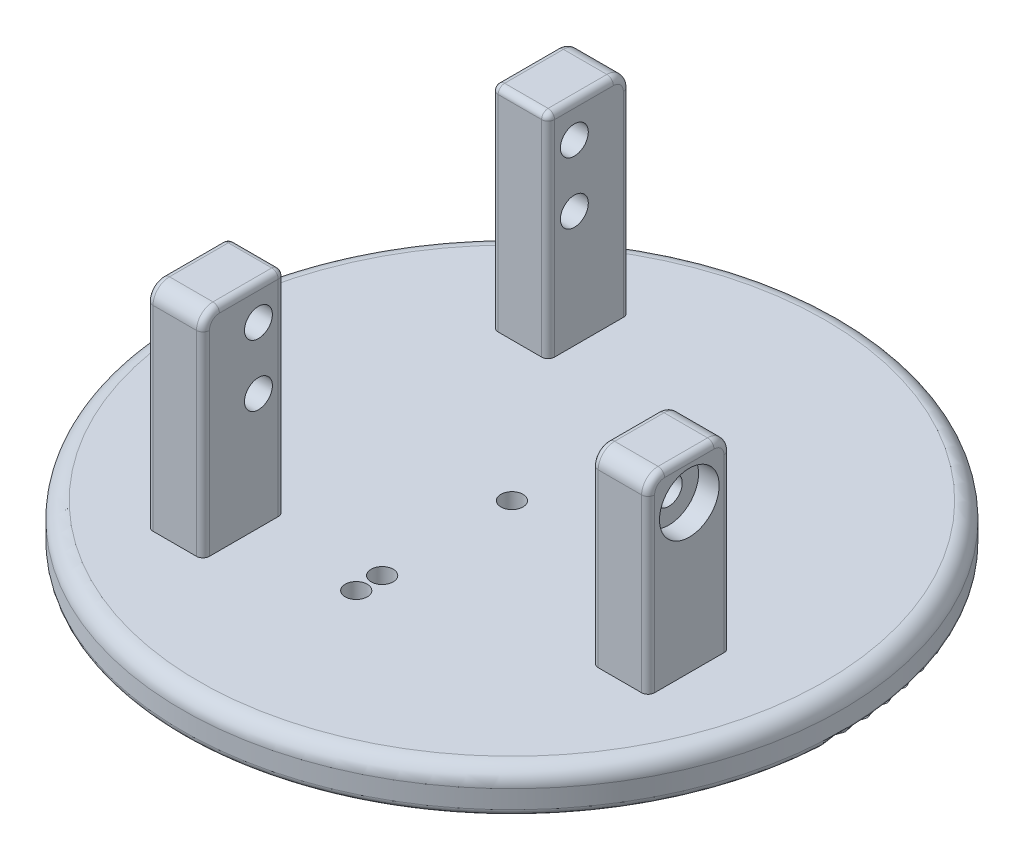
ISO-10303-21;
HEADER;
FILE_DESCRIPTION(('STEP AP214'),'2;1');
FILE_NAME('part.step','',(''),(''),'','','');
FILE_SCHEMA(('AUTOMOTIVE_DESIGN { 1 0 10303 214 1 1 1 1 }'));
ENDSEC;
DATA;
#1=APPLICATION_CONTEXT('core data for automotive mechanical design processes');
#2=APPLICATION_PROTOCOL_DEFINITION('international standard','automotive_design',2000,#1);
#3=PRODUCT_CONTEXT('',#1,'mechanical');
#4=PRODUCT('Part','Part','',(#3));
#5=PRODUCT_RELATED_PRODUCT_CATEGORY('part','',(#4));
#6=PRODUCT_DEFINITION_FORMATION('','',#4);
#7=PRODUCT_DEFINITION_CONTEXT('part definition',#1,'design');
#8=PRODUCT_DEFINITION('design','',#6,#7);
#9=PRODUCT_DEFINITION_SHAPE('','',#8);
#10=(LENGTH_UNIT() NAMED_UNIT(*) SI_UNIT(.MILLI.,.METRE.));
#11=(NAMED_UNIT(*) PLANE_ANGLE_UNIT() SI_UNIT($,.RADIAN.));
#12=(NAMED_UNIT(*) SI_UNIT($,.STERADIAN.) SOLID_ANGLE_UNIT());
#13=UNCERTAINTY_MEASURE_WITH_UNIT(LENGTH_MEASURE(1.E-05),#10,'distance_accuracy_value','');
#14=(GEOMETRIC_REPRESENTATION_CONTEXT(3) GLOBAL_UNCERTAINTY_ASSIGNED_CONTEXT((#13)) GLOBAL_UNIT_ASSIGNED_CONTEXT((#10,
#11,#12)) REPRESENTATION_CONTEXT('',''));
#15=CARTESIAN_POINT('',(0.,0.,0.));
#16=DIRECTION('',(0.,0.,1.));
#17=DIRECTION('',(1.,0.,0.));
#18=AXIS2_PLACEMENT_3D('',#15,#16,#17);
#19=CARTESIAN_POINT('',(-37.778126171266,7.57005542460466,3.75669518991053));
#20=DIRECTION('',(1.,0.,0.));
#21=DIRECTION('',(0.,0.,-1.));
#22=AXIS2_PLACEMENT_3D('',#19,#20,#21);
#23=CYLINDRICAL_SURFACE('',#22,2.084375);
#24=CARTESIAN_POINT('',(40.961873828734,7.57005542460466,3.75669518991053));
#25=DIRECTION('',(-1.,0.,0.));
#26=DIRECTION('',(0.,0.,1.));
#27=AXIS2_PLACEMENT_3D('',#24,#25,#26);
#28=CIRCLE('',#27,2.084375);
#29=CARTESIAN_POINT('',(40.961873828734,7.57005542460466,5.84107018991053));
#30=VERTEX_POINT('',#29);
#31=EDGE_CURVE('E342',#30,#30,#28,.T.);
#32=ORIENTED_EDGE('',*,*,#31,.T.);
#33=EDGE_LOOP('',(#32));
#34=FACE_BOUND('',#33,.T.);
#35=CARTESIAN_POINT('',(46.486873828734,7.57005542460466,3.75669518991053));
#36=DIRECTION('',(1.,0.,0.));
#37=DIRECTION('',(0.,0.,-1.));
#38=AXIS2_PLACEMENT_3D('',#35,#36,#37);
#39=CIRCLE('',#38,2.084375);
#40=CARTESIAN_POINT('',(46.486873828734,7.57005542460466,1.67232018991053));
#41=VERTEX_POINT('',#40);
#42=EDGE_CURVE('E42',#41,#41,#39,.F.);
#43=ORIENTED_EDGE('',*,*,#42,.F.);
#44=EDGE_LOOP('',(#43));
#45=FACE_BOUND('',#44,.T.);
#46=ADVANCED_FACE('F38',(#34,#45),#23,.F.);
#47=CARTESIAN_POINT('',(-2.85312617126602,17.5700553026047,13.5066951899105));
#48=DIRECTION('',(-1.,0.,0.));
#49=DIRECTION('',(0.,0.,1.));
#50=AXIS2_PLACEMENT_3D('',#47,#48,#49);
#51=PLANE('',#50);
#52=DIRECTION('',(0.,0.,-1.));
#53=VECTOR('',#52,1.);
#54=CARTESIAN_POINT('',(-2.85312617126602,-15.1299445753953,13.5066951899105));
#55=LINE('',#54,#53);
#56=CARTESIAN_POINT('',(-2.85312617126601,-15.1299445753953,25.2066951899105));
#57=VERTEX_POINT('',#56);
#58=CARTESIAN_POINT('',(-2.85312617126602,-15.1299445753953,14.6066951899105));
#59=VERTEX_POINT('',#58);
#60=EDGE_CURVE('E356',#57,#59,#55,.T.);
#61=ORIENTED_EDGE('',*,*,#60,.T.);
#62=DIRECTION('',(0.,-1.,0.));
#63=VECTOR('',#62,1.);
#64=CARTESIAN_POINT('',(-2.85312617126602,17.5700553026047,14.6066951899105));
#65=LINE('',#64,#63);
#66=CARTESIAN_POINT('',(-2.85312617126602,16.5700553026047,14.6066951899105));
#67=VERTEX_POINT('',#66);
#68=EDGE_CURVE('E266',#59,#67,#65,.F.);
#69=ORIENTED_EDGE('',*,*,#68,.T.);
#70=DIRECTION('',(0.,0.,-1.));
#71=VECTOR('',#70,1.);
#72=CARTESIAN_POINT('',(-2.85312617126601,16.5700553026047,23.6666951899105));
#73=LINE('',#72,#71);
#74=CARTESIAN_POINT('',(-2.85312617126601,16.5700553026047,23.6666951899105));
#75=VERTEX_POINT('',#74);
#76=EDGE_CURVE('E282',#67,#75,#73,.F.);
#77=ORIENTED_EDGE('',*,*,#76,.T.);
#78=CARTESIAN_POINT('',(-2.85312617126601,15.0300553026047,23.6666951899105));
#79=DIRECTION('',(-1.,0.,0.));
#80=DIRECTION('',(0.,0.,1.));
#81=AXIS2_PLACEMENT_3D('',#78,#79,#80);
#82=CIRCLE('',#81,1.54);
#83=CARTESIAN_POINT('',(-2.85312617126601,15.0300553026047,25.2066951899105));
#84=VERTEX_POINT('',#83);
#85=EDGE_CURVE('E408',#75,#84,#82,.F.);
#86=ORIENTED_EDGE('',*,*,#85,.T.);
#87=DIRECTION('',(0.,-1.,0.));
#88=VECTOR('',#87,1.);
#89=CARTESIAN_POINT('',(-2.85312617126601,17.5700553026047,25.2066951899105));
#90=LINE('',#89,#88);
#91=EDGE_CURVE('E410',#84,#57,#90,.T.);
#92=ORIENTED_EDGE('',*,*,#91,.T.);
#93=EDGE_LOOP('',(#61,#69,#77,#86,#92));
#94=FACE_BOUND('',#93,.T.);
#95=CARTESIAN_POINT('',(-2.85312617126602,2.82005530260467,17.6541327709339));
#96=DIRECTION('',(1.,0.,0.));
#97=DIRECTION('',(0.,0.,-1.));
#98=AXIS2_PLACEMENT_3D('',#95,#96,#97);
#99=CIRCLE('',#98,2.15);
#100=CARTESIAN_POINT('',(-2.85312617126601,2.82005530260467,15.5041327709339));
#101=VERTEX_POINT('',#100);
#102=EDGE_CURVE('E336',#101,#101,#99,.T.);
#103=ORIENTED_EDGE('',*,*,#102,.F.);
#104=EDGE_LOOP('',(#103));
#105=FACE_BOUND('',#104,.T.);
#106=CARTESIAN_POINT('',(-2.85312617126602,12.3200553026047,17.6541327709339));
#107=DIRECTION('',(1.,0.,0.));
#108=DIRECTION('',(0.,0.,-1.));
#109=AXIS2_PLACEMENT_3D('',#106,#107,#108);
#110=CIRCLE('',#109,2.15);
#111=CARTESIAN_POINT('',(-2.85312617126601,12.3200553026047,15.5041327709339));
#112=VERTEX_POINT('',#111);
#113=EDGE_CURVE('E339',#112,#112,#110,.T.);
#114=ORIENTED_EDGE('',*,*,#113,.F.);
#115=EDGE_LOOP('',(#114));
#116=FACE_BOUND('',#115,.T.);
#117=ADVANCED_FACE('F686',(#94,#105,#116),#51,.F.);
#118=CARTESIAN_POINT('',(-37.778126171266,17.5700553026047,45.2566951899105));
#119=DIRECTION('',(0.,1.,0.));
#120=DIRECTION('',(0.,0.,1.));
#121=AXIS2_PLACEMENT_3D('',#118,#119,#120);
#122=PLANE('',#121);
#123=DIRECTION('',(1.,0.,0.));
#124=VECTOR('',#123,1.);
#125=CARTESIAN_POINT('',(-2.85312617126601,17.5700553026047,23.6666951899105));
#126=LINE('',#125,#124);
#127=CARTESIAN_POINT('',(-10.553126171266,17.5700553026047,23.6666951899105));
#128=VERTEX_POINT('',#127);
#129=CARTESIAN_POINT('',(-3.85312617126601,17.5700553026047,23.6666951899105));
#130=VERTEX_POINT('',#129);
#131=EDGE_CURVE('E371',#128,#130,#126,.T.);
#132=ORIENTED_EDGE('',*,*,#131,.T.);
#133=DIRECTION('',(0.,0.,-1.));
#134=VECTOR('',#133,1.);
#135=CARTESIAN_POINT('',(-3.85312617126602,17.5700553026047,13.6066951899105));
#136=LINE('',#135,#134);
#137=CARTESIAN_POINT('',(-3.85312617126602,17.5700553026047,14.6066951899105));
#138=VERTEX_POINT('',#137);
#139=EDGE_CURVE('E425',#130,#138,#136,.T.);
#140=ORIENTED_EDGE('',*,*,#139,.T.);
#141=DIRECTION('',(-1.,0.,0.));
#142=VECTOR('',#141,1.);
#143=CARTESIAN_POINT('',(-37.778126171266,17.5700553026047,14.6066951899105));
#144=LINE('',#143,#142);
#145=CARTESIAN_POINT('',(-10.553126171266,17.5700553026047,14.6066951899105));
#146=VERTEX_POINT('',#145);
#147=EDGE_CURVE('E423',#138,#146,#144,.T.);
#148=ORIENTED_EDGE('',*,*,#147,.T.);
#149=DIRECTION('',(0.,0.,-1.));
#150=VECTOR('',#149,1.);
#151=CARTESIAN_POINT('',(-10.553126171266,17.5700553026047,23.6666951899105));
#152=LINE('',#151,#150);
#153=EDGE_CURVE('E421',#146,#128,#152,.F.);
#154=ORIENTED_EDGE('',*,*,#153,.T.);
#155=EDGE_LOOP('',(#132,#140,#148,#154));
#156=FACE_BOUND('',#155,.T.);
#157=ADVANCED_FACE('F692',(#156),#122,.T.);
#158=CARTESIAN_POINT('',(-11.553126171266,-28.4449736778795,13.5066951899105));
#159=DIRECTION('',(1.,0.,0.));
#160=DIRECTION('',(0.,0.,-1.));
#161=AXIS2_PLACEMENT_3D('',#158,#159,#160);
#162=PLANE('',#161);
#163=CARTESIAN_POINT('',(-11.553126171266,2.82005530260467,17.6541327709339));
#164=DIRECTION('',(1.,0.,0.));
#165=DIRECTION('',(0.,0.,-1.));
#166=AXIS2_PLACEMENT_3D('',#163,#164,#165);
#167=CIRCLE('',#166,2.15);
#168=CARTESIAN_POINT('',(-11.553126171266,2.82005530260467,15.5041327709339));
#169=VERTEX_POINT('',#168);
#170=EDGE_CURVE('E329',#169,#169,#167,.F.);
#171=ORIENTED_EDGE('',*,*,#170,.F.);
#172=EDGE_LOOP('',(#171));
#173=FACE_BOUND('',#172,.T.);
#174=CARTESIAN_POINT('',(-11.553126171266,12.3200553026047,17.6541327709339));
#175=DIRECTION('',(1.,0.,0.));
#176=DIRECTION('',(0.,0.,-1.));
#177=AXIS2_PLACEMENT_3D('',#174,#175,#176);
#178=CIRCLE('',#177,2.15);
#179=CARTESIAN_POINT('',(-11.553126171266,12.3200553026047,15.5041327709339));
#180=VERTEX_POINT('',#179);
#181=EDGE_CURVE('E328',#180,#180,#178,.F.);
#182=ORIENTED_EDGE('',*,*,#181,.F.);
#183=EDGE_LOOP('',(#182));
#184=FACE_BOUND('',#183,.T.);
#185=DIRECTION('',(0.,0.,-1.));
#186=VECTOR('',#185,1.);
#187=CARTESIAN_POINT('',(-11.553126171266,16.5700553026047,13.6066951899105));
#188=LINE('',#187,#186);
#189=CARTESIAN_POINT('',(-11.553126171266,16.5700553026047,23.6666951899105));
#190=VERTEX_POINT('',#189);
#191=CARTESIAN_POINT('',(-11.553126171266,16.5700553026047,14.6066951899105));
#192=VERTEX_POINT('',#191);
#193=EDGE_CURVE('E413',#190,#192,#188,.T.);
#194=ORIENTED_EDGE('',*,*,#193,.T.);
#195=DIRECTION('',(0.,1.,0.));
#196=VECTOR('',#195,1.);
#197=CARTESIAN_POINT('',(-11.553126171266,-15.1299445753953,14.6066951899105));
#198=LINE('',#197,#196);
#199=CARTESIAN_POINT('',(-11.553126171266,-15.1299445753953,14.6066951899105));
#200=VERTEX_POINT('',#199);
#201=EDGE_CURVE('E419',#192,#200,#198,.F.);
#202=ORIENTED_EDGE('',*,*,#201,.T.);
#203=DIRECTION('',(0.,0.,-1.));
#204=VECTOR('',#203,1.);
#205=CARTESIAN_POINT('',(-11.553126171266,-15.1299445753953,13.5066951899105));
#206=LINE('',#205,#204);
#207=CARTESIAN_POINT('',(-11.553126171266,-15.1299445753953,25.2066951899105));
#208=VERTEX_POINT('',#207);
#209=EDGE_CURVE('E326',#208,#200,#206,.T.);
#210=ORIENTED_EDGE('',*,*,#209,.F.);
#211=DIRECTION('',(0.,1.,0.));
#212=VECTOR('',#211,1.);
#213=CARTESIAN_POINT('',(-11.553126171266,-28.4449736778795,25.2066951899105));
#214=LINE('',#213,#212);
#215=CARTESIAN_POINT('',(-11.553126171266,15.0300553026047,25.2066951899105));
#216=VERTEX_POINT('',#215);
#217=EDGE_CURVE('E417',#208,#216,#214,.T.);
#218=ORIENTED_EDGE('',*,*,#217,.T.);
#219=CARTESIAN_POINT('',(-11.553126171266,15.0300553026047,23.6666951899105));
#220=DIRECTION('',(1.,0.,0.));
#221=DIRECTION('',(0.,0.,-1.));
#222=AXIS2_PLACEMENT_3D('',#219,#220,#221);
#223=CIRCLE('',#222,1.54);
#224=EDGE_CURVE('E415',#216,#190,#223,.F.);
#225=ORIENTED_EDGE('',*,*,#224,.T.);
#226=EDGE_LOOP('',(#194,#202,#210,#218,#225));
#227=FACE_BOUND('',#226,.T.);
#228=ADVANCED_FACE('F711',(#173,#184,#227),#162,.F.);
#229=CARTESIAN_POINT('',(44.771873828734,13.8184554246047,-2.59330481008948));
#230=DIRECTION('',(0.,0.,1.));
#231=DIRECTION('',(1.,0.,0.));
#232=AXIS2_PLACEMENT_3D('',#229,#230,#231);
#233=PLANE('',#232);
#234=DIRECTION('',(-1.,0.,0.));
#235=VECTOR('',#234,1.);
#236=CARTESIAN_POINT('',(53.661873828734,11.2784554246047,-2.59330481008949));
#237=LINE('',#236,#235);
#238=CARTESIAN_POINT('',(41.961873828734,11.2784554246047,-2.59330481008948));
#239=VERTEX_POINT('',#238);
#240=CARTESIAN_POINT('',(48.661873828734,11.2784554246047,-2.59330481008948));
#241=VERTEX_POINT('',#240);
#242=EDGE_CURVE('E383',#239,#241,#237,.F.);
#243=ORIENTED_EDGE('',*,*,#242,.T.);
#244=DIRECTION('',(0.,1.,0.));
#245=VECTOR('',#244,1.);
#246=CARTESIAN_POINT('',(48.661873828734,13.8184554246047,-2.59330481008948));
#247=LINE('',#246,#245);
#248=CARTESIAN_POINT('',(48.661873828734,-15.1299445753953,-2.59330481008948));
#249=VERTEX_POINT('',#248);
#250=EDGE_CURVE('E448',#241,#249,#247,.F.);
#251=ORIENTED_EDGE('',*,*,#250,.T.);
#252=DIRECTION('',(-1.,0.,0.));
#253=VECTOR('',#252,1.);
#254=CARTESIAN_POINT('',(44.771873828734,-15.1299445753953,-2.59330481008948));
#255=LINE('',#254,#253);
#256=CARTESIAN_POINT('',(41.961873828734,-15.1299445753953,-2.59330481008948));
#257=VERTEX_POINT('',#256);
#258=EDGE_CURVE('E350',#249,#257,#255,.T.);
#259=ORIENTED_EDGE('',*,*,#258,.T.);
#260=DIRECTION('',(0.,-1.,0.));
#261=VECTOR('',#260,1.);
#262=CARTESIAN_POINT('',(41.961873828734,11.2784554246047,-2.59330481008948));
#263=LINE('',#262,#261);
#264=EDGE_CURVE('E446',#257,#239,#263,.F.);
#265=ORIENTED_EDGE('',*,*,#264,.T.);
#266=EDGE_LOOP('',(#243,#251,#259,#265));
#267=FACE_BOUND('',#266,.T.);
#268=ADVANCED_FACE('F707',(#267),#233,.F.);
#269=CARTESIAN_POINT('',(44.771873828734,13.8184554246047,10.1066951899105));
#270=DIRECTION('',(0.,0.,-1.));
#271=DIRECTION('',(-1.,0.,0.));
#272=AXIS2_PLACEMENT_3D('',#269,#270,#271);
#273=PLANE('',#272);
#274=DIRECTION('',(1.,0.,0.));
#275=VECTOR('',#274,1.);
#276=CARTESIAN_POINT('',(44.771873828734,-15.1299445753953,10.1066951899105));
#277=LINE('',#276,#275);
#278=CARTESIAN_POINT('',(41.961873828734,-15.1299445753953,10.1066951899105));
#279=VERTEX_POINT('',#278);
#280=CARTESIAN_POINT('',(48.661873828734,-15.1299445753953,10.1066951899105));
#281=VERTEX_POINT('',#280);
#282=EDGE_CURVE('E353',#279,#281,#277,.T.);
#283=ORIENTED_EDGE('',*,*,#282,.T.);
#284=DIRECTION('',(0.,1.,0.));
#285=VECTOR('',#284,1.);
#286=CARTESIAN_POINT('',(48.661873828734,13.8184554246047,10.1066951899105));
#287=LINE('',#286,#285);
#288=CARTESIAN_POINT('',(48.661873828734,11.2784554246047,10.1066951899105));
#289=VERTEX_POINT('',#288);
#290=EDGE_CURVE('E464',#281,#289,#287,.T.);
#291=ORIENTED_EDGE('',*,*,#290,.T.);
#292=DIRECTION('',(1.,0.,0.));
#293=VECTOR('',#292,1.);
#294=CARTESIAN_POINT('',(40.961873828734,11.2784554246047,10.1066951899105));
#295=LINE('',#294,#293);
#296=CARTESIAN_POINT('',(41.961873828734,11.2784554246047,10.1066951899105));
#297=VERTEX_POINT('',#296);
#298=EDGE_CURVE('E386',#289,#297,#295,.F.);
#299=ORIENTED_EDGE('',*,*,#298,.T.);
#300=DIRECTION('',(0.,1.,0.));
#301=VECTOR('',#300,1.);
#302=CARTESIAN_POINT('',(41.961873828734,-15.1299445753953,10.1066951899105));
#303=LINE('',#302,#301);
#304=EDGE_CURVE('E462',#297,#279,#303,.F.);
#305=ORIENTED_EDGE('',*,*,#304,.T.);
#306=EDGE_LOOP('',(#283,#291,#299,#305));
#307=FACE_BOUND('',#306,.T.);
#308=ADVANCED_FACE('F703',(#307),#273,.F.);
#309=CARTESIAN_POINT('',(-37.778126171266,13.8184554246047,45.2566951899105));
#310=DIRECTION('',(0.,1.,0.));
#311=DIRECTION('',(0.,0.,1.));
#312=AXIS2_PLACEMENT_3D('',#309,#310,#311);
#313=PLANE('',#312);
#314=DIRECTION('',(1.,0.,0.));
#315=VECTOR('',#314,1.);
#316=CARTESIAN_POINT('',(53.661873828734,13.8184554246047,7.56669518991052));
#317=LINE('',#316,#315);
#318=CARTESIAN_POINT('',(41.961873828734,13.8184554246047,7.56669518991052));
#319=VERTEX_POINT('',#318);
#320=CARTESIAN_POINT('',(48.661873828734,13.8184554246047,7.56669518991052));
#321=VERTEX_POINT('',#320);
#322=EDGE_CURVE('E377',#319,#321,#317,.T.);
#323=ORIENTED_EDGE('',*,*,#322,.T.);
#324=DIRECTION('',(0.,0.,1.));
#325=VECTOR('',#324,1.);
#326=CARTESIAN_POINT('',(48.661873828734,13.8184554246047,-0.0533048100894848));
#327=LINE('',#326,#325);
#328=CARTESIAN_POINT('',(48.661873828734,13.8184554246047,-0.0533048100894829));
#329=VERTEX_POINT('',#328);
#330=EDGE_CURVE('E456',#321,#329,#327,.F.);
#331=ORIENTED_EDGE('',*,*,#330,.T.);
#332=DIRECTION('',(-1.,0.,0.));
#333=VECTOR('',#332,1.);
#334=CARTESIAN_POINT('',(40.961873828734,13.8184554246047,-0.0533048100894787));
#335=LINE('',#334,#333);
#336=CARTESIAN_POINT('',(41.961873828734,13.8184554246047,-0.0533048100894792));
#337=VERTEX_POINT('',#336);
#338=EDGE_CURVE('E380',#329,#337,#335,.T.);
#339=ORIENTED_EDGE('',*,*,#338,.T.);
#340=DIRECTION('',(0.,0.,-1.));
#341=VECTOR('',#340,1.);
#342=CARTESIAN_POINT('',(41.961873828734,13.8184554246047,45.2566951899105));
#343=LINE('',#342,#341);
#344=EDGE_CURVE('E454',#337,#319,#343,.F.);
#345=ORIENTED_EDGE('',*,*,#344,.T.);
#346=EDGE_LOOP('',(#323,#331,#339,#345));
#347=FACE_BOUND('',#346,.T.);
#348=ADVANCED_FACE('F700',(#347),#313,.T.);
#349=CARTESIAN_POINT('',(-37.778126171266,-15.1299445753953,45.2566951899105));
#350=DIRECTION('',(0.,-1.,0.));
#351=DIRECTION('',(0.,0.,-1.));
#352=AXIS2_PLACEMENT_3D('',#349,#350,#351);
#353=PLANE('',#352);
#354=DIRECTION('',(1.,0.,0.));
#355=VECTOR('',#354,1.);
#356=CARTESIAN_POINT('',(-15.553126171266,-15.1299445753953,26.2066951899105));
#357=LINE('',#356,#355);
#358=CARTESIAN_POINT('',(-10.553126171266,-15.1299445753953,26.2066951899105));
#359=VERTEX_POINT('',#358);
#360=CARTESIAN_POINT('',(-3.85312617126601,-15.1299445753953,26.2066951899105));
#361=VERTEX_POINT('',#360);
#362=EDGE_CURVE('E358',#359,#361,#357,.T.);
#363=ORIENTED_EDGE('',*,*,#362,.F.);
#364=CARTESIAN_POINT('',(-10.553126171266,-15.1299445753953,25.2066951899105));
#365=DIRECTION('',(0.,-1.,0.));
#366=DIRECTION('',(0.,0.,-1.));
#367=AXIS2_PLACEMENT_3D('',#364,#365,#366);
#368=CIRCLE('',#367,1.);
#369=EDGE_CURVE('E479',#359,#208,#368,.T.);
#370=ORIENTED_EDGE('',*,*,#369,.T.);
#371=ORIENTED_EDGE('',*,*,#209,.T.);
#372=CARTESIAN_POINT('',(-10.553126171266,-15.1299445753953,14.6066951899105));
#373=DIRECTION('',(0.,-1.,0.));
#374=DIRECTION('',(0.,0.,-1.));
#375=AXIS2_PLACEMENT_3D('',#372,#373,#374);
#376=CIRCLE('',#375,1.);
#377=CARTESIAN_POINT('',(-10.553126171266,-15.1299445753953,13.6066951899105));
#378=VERTEX_POINT('',#377);
#379=EDGE_CURVE('E271',#200,#378,#376,.T.);
#380=ORIENTED_EDGE('',*,*,#379,.T.);
#381=DIRECTION('',(-1.,0.,0.));
#382=VECTOR('',#381,1.);
#383=CARTESIAN_POINT('',(63.821873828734,-15.1299445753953,13.6066951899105));
#384=LINE('',#383,#382);
#385=CARTESIAN_POINT('',(-3.85312617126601,-15.1299445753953,13.6066951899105));
#386=VERTEX_POINT('',#385);
#387=EDGE_CURVE('E277',#386,#378,#384,.T.);
#388=ORIENTED_EDGE('',*,*,#387,.F.);
#389=CARTESIAN_POINT('',(-3.85312617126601,-15.1299445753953,14.6066951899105));
#390=DIRECTION('',(0.,-1.,0.));
#391=DIRECTION('',(0.,0.,-1.));
#392=AXIS2_PLACEMENT_3D('',#389,#390,#391);
#393=CIRCLE('',#392,1.);
#394=EDGE_CURVE('E261',#386,#59,#393,.T.);
#395=ORIENTED_EDGE('',*,*,#394,.T.);
#396=ORIENTED_EDGE('',*,*,#60,.F.);
#397=CARTESIAN_POINT('',(-3.85312617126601,-15.1299445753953,25.2066951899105));
#398=DIRECTION('',(0.,-1.,0.));
#399=DIRECTION('',(0.,0.,-1.));
#400=AXIS2_PLACEMENT_3D('',#397,#398,#399);
#401=CIRCLE('',#400,1.);
#402=EDGE_CURVE('E477',#57,#361,#401,.T.);
#403=ORIENTED_EDGE('',*,*,#402,.T.);
#404=EDGE_LOOP('',(#363,#370,#371,#380,#388,#395,#396,#403));
#405=FACE_BOUND('',#404,.T.);
#406=CARTESIAN_POINT('',(13.021873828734,-15.1299445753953,14.4566951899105));
#407=DIRECTION('',(0.,-1.,0.));
#408=DIRECTION('',(0.,0.,-1.));
#409=AXIS2_PLACEMENT_3D('',#406,#407,#408);
#410=CIRCLE('',#409,1.7);
#411=CARTESIAN_POINT('',(13.021873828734,-15.1299445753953,12.7566951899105));
#412=VERTEX_POINT('',#411);
#413=EDGE_CURVE('E311',#412,#412,#410,.T.);
#414=ORIENTED_EDGE('',*,*,#413,.T.);
#415=EDGE_LOOP('',(#414));
#416=FACE_BOUND('',#415,.T.);
#417=CARTESIAN_POINT('',(13.021873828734,-15.1299445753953,-5.54330481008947));
#418=DIRECTION('',(0.,-1.,0.));
#419=DIRECTION('',(0.,0.,-1.));
#420=AXIS2_PLACEMENT_3D('',#417,#418,#419);
#421=CIRCLE('',#420,48.26);
#422=CARTESIAN_POINT('',(13.021873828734,-15.1299445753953,-53.8033048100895));
#423=VERTEX_POINT('',#422);
#424=EDGE_CURVE('E389',#423,#423,#421,.F.);
#425=ORIENTED_EDGE('',*,*,#424,.T.);
#426=EDGE_LOOP('',(#425));
#427=FACE_BOUND('',#426,.T.);
#428=DIRECTION('',(0.,0.,-1.));
#429=VECTOR('',#428,1.);
#430=CARTESIAN_POINT('',(-2.85312617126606,-15.1299445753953,-39.5933048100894));
#431=LINE('',#430,#429);
#432=CARTESIAN_POINT('',(-2.85312617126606,-15.1299445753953,-27.9933048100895));
#433=VERTEX_POINT('',#432);
#434=CARTESIAN_POINT('',(-2.85312617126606,-15.1299445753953,-38.5933048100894));
#435=VERTEX_POINT('',#434);
#436=EDGE_CURVE('E361',#433,#435,#431,.T.);
#437=ORIENTED_EDGE('',*,*,#436,.F.);
#438=CARTESIAN_POINT('',(-3.85312617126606,-15.1299445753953,-27.9933048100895));
#439=DIRECTION('',(0.,-1.,0.));
#440=DIRECTION('',(0.,0.,-1.));
#441=AXIS2_PLACEMENT_3D('',#438,#439,#440);
#442=CIRCLE('',#441,1.);
#443=CARTESIAN_POINT('',(-3.85312617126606,-15.1299445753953,-26.9933048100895));
#444=VERTEX_POINT('',#443);
#445=EDGE_CURVE('E576',#433,#444,#442,.T.);
#446=ORIENTED_EDGE('',*,*,#445,.T.);
#447=DIRECTION('',(-1.,0.,0.));
#448=VECTOR('',#447,1.);
#449=CARTESIAN_POINT('',(63.821873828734,-15.1299445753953,-26.9933048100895));
#450=LINE('',#449,#448);
#451=CARTESIAN_POINT('',(-10.5531261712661,-15.1299445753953,-26.9933048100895));
#452=VERTEX_POINT('',#451);
#453=EDGE_CURVE('E291',#444,#452,#450,.T.);
#454=ORIENTED_EDGE('',*,*,#453,.T.);
#455=CARTESIAN_POINT('',(-10.5531261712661,-15.1299445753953,-27.9933048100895));
#456=DIRECTION('',(0.,-1.,0.));
#457=DIRECTION('',(0.,0.,-1.));
#458=AXIS2_PLACEMENT_3D('',#455,#456,#457);
#459=CIRCLE('',#458,1.);
#460=CARTESIAN_POINT('',(-11.5531261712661,-15.1299445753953,-27.9933048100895));
#461=VERTEX_POINT('',#460);
#462=EDGE_CURVE('E578',#452,#461,#459,.T.);
#463=ORIENTED_EDGE('',*,*,#462,.T.);
#464=DIRECTION('',(0.,0.,-1.));
#465=VECTOR('',#464,1.);
#466=CARTESIAN_POINT('',(-11.5531261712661,-15.1299445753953,-26.8933048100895));
#467=LINE('',#466,#465);
#468=CARTESIAN_POINT('',(-11.5531261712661,-15.1299445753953,-38.5933048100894));
#469=VERTEX_POINT('',#468);
#470=EDGE_CURVE('E320',#461,#469,#467,.T.);
#471=ORIENTED_EDGE('',*,*,#470,.T.);
#472=CARTESIAN_POINT('',(-10.5531261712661,-15.1299445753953,-38.5933048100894));
#473=DIRECTION('',(0.,-1.,0.));
#474=DIRECTION('',(0.,0.,-1.));
#475=AXIS2_PLACEMENT_3D('',#472,#473,#474);
#476=CIRCLE('',#475,1.);
#477=CARTESIAN_POINT('',(-10.5531261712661,-15.1299445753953,-39.5933048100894));
#478=VERTEX_POINT('',#477);
#479=EDGE_CURVE('E11',#469,#478,#476,.T.);
#480=ORIENTED_EDGE('',*,*,#479,.T.);
#481=DIRECTION('',(-1.,0.,0.));
#482=VECTOR('',#481,1.);
#483=CARTESIAN_POINT('',(-15.5531261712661,-15.1299445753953,-39.5933048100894));
#484=LINE('',#483,#482);
#485=CARTESIAN_POINT('',(-3.85312617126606,-15.1299445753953,-39.5933048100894));
#486=VERTEX_POINT('',#485);
#487=EDGE_CURVE('E364',#486,#478,#484,.T.);
#488=ORIENTED_EDGE('',*,*,#487,.F.);
#489=CARTESIAN_POINT('',(-3.85312617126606,-15.1299445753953,-38.5933048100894));
#490=DIRECTION('',(0.,-1.,0.));
#491=DIRECTION('',(0.,0.,-1.));
#492=AXIS2_PLACEMENT_3D('',#489,#490,#491);
#493=CIRCLE('',#492,1.);
#494=EDGE_CURVE('E47',#486,#435,#493,.T.);
#495=ORIENTED_EDGE('',*,*,#494,.T.);
#496=EDGE_LOOP('',(#437,#446,#454,#463,#471,#480,#488,#495));
#497=FACE_BOUND('',#496,.T.);
#498=ORIENTED_EDGE('',*,*,#258,.F.);
#499=CARTESIAN_POINT('',(48.661873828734,-15.1299445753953,-1.59330481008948));
#500=DIRECTION('',(0.,-1.,0.));
#501=DIRECTION('',(0.,0.,-1.));
#502=AXIS2_PLACEMENT_3D('',#499,#500,#501);
#503=CIRCLE('',#502,1.);
#504=CARTESIAN_POINT('',(49.661873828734,-15.1299445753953,-1.59330481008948));
#505=VERTEX_POINT('',#504);
#506=EDGE_CURVE('E481',#249,#505,#503,.T.);
#507=ORIENTED_EDGE('',*,*,#506,.T.);
#508=DIRECTION('',(0.,0.,1.));
#509=VECTOR('',#508,1.);
#510=CARTESIAN_POINT('',(49.661873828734,-15.1299445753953,-2.59330481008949));
#511=LINE('',#510,#509);
#512=CARTESIAN_POINT('',(49.661873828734,-15.1299445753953,9.10669518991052));
#513=VERTEX_POINT('',#512);
#514=EDGE_CURVE('E317',#505,#513,#511,.T.);
#515=ORIENTED_EDGE('',*,*,#514,.T.);
#516=CARTESIAN_POINT('',(48.661873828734,-15.1299445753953,9.10669518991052));
#517=DIRECTION('',(0.,-1.,0.));
#518=DIRECTION('',(0.,0.,-1.));
#519=AXIS2_PLACEMENT_3D('',#516,#517,#518);
#520=CIRCLE('',#519,1.);
#521=EDGE_CURVE('E483',#513,#281,#520,.T.);
#522=ORIENTED_EDGE('',*,*,#521,.T.);
#523=ORIENTED_EDGE('',*,*,#282,.F.);
#524=CARTESIAN_POINT('',(41.961873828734,-15.1299445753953,9.10669518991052));
#525=DIRECTION('',(0.,-1.,0.));
#526=DIRECTION('',(0.,0.,-1.));
#527=AXIS2_PLACEMENT_3D('',#524,#525,#526);
#528=CIRCLE('',#527,1.);
#529=CARTESIAN_POINT('',(40.961873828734,-15.1299445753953,9.10669518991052));
#530=VERTEX_POINT('',#529);
#531=EDGE_CURVE('E485',#279,#530,#528,.T.);
#532=ORIENTED_EDGE('',*,*,#531,.T.);
#533=DIRECTION('',(0.,0.,1.));
#534=VECTOR('',#533,1.);
#535=CARTESIAN_POINT('',(40.961873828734,-15.1299445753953,-2.59330481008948));
#536=LINE('',#535,#534);
#537=CARTESIAN_POINT('',(40.961873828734,-15.1299445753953,-1.59330481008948));
#538=VERTEX_POINT('',#537);
#539=EDGE_CURVE('E347',#538,#530,#536,.T.);
#540=ORIENTED_EDGE('',*,*,#539,.F.);
#541=CARTESIAN_POINT('',(41.961873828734,-15.1299445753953,-1.59330481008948));
#542=DIRECTION('',(0.,-1.,0.));
#543=DIRECTION('',(0.,0.,-1.));
#544=AXIS2_PLACEMENT_3D('',#541,#542,#543);
#545=CIRCLE('',#544,1.);
#546=EDGE_CURVE('E487',#538,#257,#545,.T.);
#547=ORIENTED_EDGE('',*,*,#546,.T.);
#548=EDGE_LOOP('',(#498,#507,#515,#522,#523,#532,#540,#547));
#549=FACE_BOUND('',#548,.T.);
#550=CARTESIAN_POINT('',(13.021873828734,-15.1299445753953,-5.54330481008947));
#551=DIRECTION('',(0.,-1.,0.));
#552=DIRECTION('',(0.,0.,-1.));
#553=AXIS2_PLACEMENT_3D('',#550,#551,#552);
#554=CIRCLE('',#553,1.7);
#555=CARTESIAN_POINT('',(13.021873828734,-15.1299445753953,-7.24330481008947));
#556=VERTEX_POINT('',#555);
#557=EDGE_CURVE('E314',#556,#556,#554,.T.);
#558=ORIENTED_EDGE('',*,*,#557,.T.);
#559=EDGE_LOOP('',(#558));
#560=FACE_BOUND('',#559,.T.);
#561=CARTESIAN_POINT('',(13.021873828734,-15.1299445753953,18.4566951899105));
#562=DIRECTION('',(0.,-1.,0.));
#563=DIRECTION('',(0.,0.,-1.));
#564=AXIS2_PLACEMENT_3D('',#561,#562,#563);
#565=CIRCLE('',#564,1.7);
#566=CARTESIAN_POINT('',(13.021873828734,-15.1299445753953,16.7566951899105));
#567=VERTEX_POINT('',#566);
#568=EDGE_CURVE('E306',#567,#567,#565,.T.);
#569=ORIENTED_EDGE('',*,*,#568,.T.);
#570=EDGE_LOOP('',(#569));
#571=FACE_BOUND('',#570,.T.);
#572=ADVANCED_FACE('F286',(#405,#416,#427,#497,#549,#560,#571),#353,.F.);
#573=CARTESIAN_POINT('',(-37.778126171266,-21.4799445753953,45.2566951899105));
#574=DIRECTION('',(0.,-1.,0.));
#575=DIRECTION('',(0.,0.,-1.));
#576=AXIS2_PLACEMENT_3D('',#573,#574,#575);
#577=PLANE('',#576);
#578=CARTESIAN_POINT('',(13.021873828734,-21.4799445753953,-5.54330481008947));
#579=DIRECTION('',(0.,-1.,0.));
#580=DIRECTION('',(0.,0.,-1.));
#581=AXIS2_PLACEMENT_3D('',#578,#579,#580);
#582=CIRCLE('',#581,1.7);
#583=CARTESIAN_POINT('',(13.021873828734,-21.4799445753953,-7.24330481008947));
#584=VERTEX_POINT('',#583);
#585=EDGE_CURVE('E303',#584,#584,#582,.T.);
#586=ORIENTED_EDGE('',*,*,#585,.F.);
#587=EDGE_LOOP('',(#586));
#588=FACE_BOUND('',#587,.T.);
#589=CARTESIAN_POINT('',(13.021873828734,-21.4799445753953,14.4566951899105));
#590=DIRECTION('',(0.,-1.,0.));
#591=DIRECTION('',(0.,0.,-1.));
#592=AXIS2_PLACEMENT_3D('',#589,#590,#591);
#593=CIRCLE('',#592,1.7);
#594=CARTESIAN_POINT('',(13.021873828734,-21.4799445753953,12.7566951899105));
#595=VERTEX_POINT('',#594);
#596=EDGE_CURVE('E294',#595,#595,#593,.T.);
#597=ORIENTED_EDGE('',*,*,#596,.F.);
#598=EDGE_LOOP('',(#597));
#599=FACE_BOUND('',#598,.T.);
#600=CARTESIAN_POINT('',(13.021873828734,-21.4799445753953,18.4566951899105));
#601=DIRECTION('',(0.,-1.,0.));
#602=DIRECTION('',(0.,0.,-1.));
#603=AXIS2_PLACEMENT_3D('',#600,#601,#602);
#604=CIRCLE('',#603,1.7);
#605=CARTESIAN_POINT('',(13.021873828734,-21.4799445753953,16.7566951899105));
#606=VERTEX_POINT('',#605);
#607=EDGE_CURVE('E290',#606,#606,#604,.T.);
#608=ORIENTED_EDGE('',*,*,#607,.F.);
#609=EDGE_LOOP('',(#608));
#610=FACE_BOUND('',#609,.T.);
#611=CARTESIAN_POINT('',(13.021873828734,-21.4799445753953,-5.54330481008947));
#612=DIRECTION('',(0.,-1.,0.));
#613=DIRECTION('',(0.,0.,-1.));
#614=AXIS2_PLACEMENT_3D('',#611,#612,#613);
#615=CIRCLE('',#614,49.8);
#616=CARTESIAN_POINT('',(13.021873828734,-21.4799445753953,-55.3433048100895));
#617=VERTEX_POINT('',#616);
#618=EDGE_CURVE('E402',#617,#617,#615,.T.);
#619=ORIENTED_EDGE('',*,*,#618,.T.);
#620=EDGE_LOOP('',(#619));
#621=FACE_BOUND('',#620,.T.);
#622=ADVANCED_FACE('F726',(#588,#599,#610,#621),#577,.T.);
#623=CARTESIAN_POINT('',(-2.85312617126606,17.5700553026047,-39.5933048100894));
#624=DIRECTION('',(-1.,0.,0.));
#625=DIRECTION('',(0.,0.,1.));
#626=AXIS2_PLACEMENT_3D('',#623,#624,#625);
#627=PLANE('',#626);
#628=CARTESIAN_POINT('',(-2.85312617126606,12.3200553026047,-31.0407423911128));
#629=DIRECTION('',(1.,0.,0.));
#630=DIRECTION('',(0.,0.,-1.));
#631=AXIS2_PLACEMENT_3D('',#628,#629,#630);
#632=CIRCLE('',#631,2.15);
#633=CARTESIAN_POINT('',(-2.85312617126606,12.3200553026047,-33.1907423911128));
#634=VERTEX_POINT('',#633);
#635=EDGE_CURVE('E333',#634,#634,#632,.T.);
#636=ORIENTED_EDGE('',*,*,#635,.F.);
#637=EDGE_LOOP('',(#636));
#638=FACE_BOUND('',#637,.T.);
#639=CARTESIAN_POINT('',(-2.85312617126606,2.82005530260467,-31.0407423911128));
#640=DIRECTION('',(1.,0.,0.));
#641=DIRECTION('',(0.,0.,-1.));
#642=AXIS2_PLACEMENT_3D('',#639,#640,#641);
#643=CIRCLE('',#642,2.15);
#644=CARTESIAN_POINT('',(-2.85312617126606,2.82005530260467,-33.1907423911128));
#645=VERTEX_POINT('',#644);
#646=EDGE_CURVE('E332',#645,#645,#643,.T.);
#647=ORIENTED_EDGE('',*,*,#646,.F.);
#648=EDGE_LOOP('',(#647));
#649=FACE_BOUND('',#648,.T.);
#650=DIRECTION('',(0.,0.,-1.));
#651=VECTOR('',#650,1.);
#652=CARTESIAN_POINT('',(-2.85312617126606,16.5700553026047,-26.9933048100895));
#653=LINE('',#652,#651);
#654=CARTESIAN_POINT('',(-2.85312617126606,16.5700553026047,-37.0533048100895));
#655=VERTEX_POINT('',#654);
#656=CARTESIAN_POINT('',(-2.85312617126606,16.5700553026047,-27.9933048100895));
#657=VERTEX_POINT('',#656);
#658=EDGE_CURVE('E557',#655,#657,#653,.F.);
#659=ORIENTED_EDGE('',*,*,#658,.T.);
#660=DIRECTION('',(0.,-1.,0.));
#661=VECTOR('',#660,1.);
#662=CARTESIAN_POINT('',(-2.85312617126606,17.5700553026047,-27.9933048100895));
#663=LINE('',#662,#661);
#664=EDGE_CURVE('E559',#657,#433,#663,.T.);
#665=ORIENTED_EDGE('',*,*,#664,.T.);
#666=ORIENTED_EDGE('',*,*,#436,.T.);
#667=DIRECTION('',(0.,-1.,0.));
#668=VECTOR('',#667,1.);
#669=CARTESIAN_POINT('',(-2.85312617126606,17.5700553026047,-38.5933048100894));
#670=LINE('',#669,#668);
#671=CARTESIAN_POINT('',(-2.85312617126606,15.0300553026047,-38.5933048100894));
#672=VERTEX_POINT('',#671);
#673=EDGE_CURVE('E553',#435,#672,#670,.F.);
#674=ORIENTED_EDGE('',*,*,#673,.T.);
#675=CARTESIAN_POINT('',(-2.85312617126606,15.0300553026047,-37.0533048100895));
#676=DIRECTION('',(-1.,0.,0.));
#677=DIRECTION('',(0.,0.,1.));
#678=AXIS2_PLACEMENT_3D('',#675,#676,#677);
#679=CIRCLE('',#678,1.54);
#680=EDGE_CURVE('E555',#672,#655,#679,.F.);
#681=ORIENTED_EDGE('',*,*,#680,.T.);
#682=EDGE_LOOP('',(#659,#665,#666,#674,#681));
#683=FACE_BOUND('',#682,.T.);
#684=ADVANCED_FACE('F620',(#638,#649,#683),#627,.F.);
#685=CARTESIAN_POINT('',(-15.5531261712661,17.5700553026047,-39.5933048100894));
#686=DIRECTION('',(0.,0.,1.));
#687=DIRECTION('',(1.,0.,0.));
#688=AXIS2_PLACEMENT_3D('',#685,#686,#687);
#689=PLANE('',#688);
#690=DIRECTION('',(-1.,0.,0.));
#691=VECTOR('',#690,1.);
#692=CARTESIAN_POINT('',(-2.85312617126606,15.0300553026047,-39.5933048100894));
#693=LINE('',#692,#691);
#694=CARTESIAN_POINT('',(-10.5531261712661,15.0300553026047,-39.5933048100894));
#695=VERTEX_POINT('',#694);
#696=CARTESIAN_POINT('',(-3.85312617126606,15.0300553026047,-39.5933048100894));
#697=VERTEX_POINT('',#696);
#698=EDGE_CURVE('E369',#695,#697,#693,.F.);
#699=ORIENTED_EDGE('',*,*,#698,.T.);
#700=DIRECTION('',(0.,-1.,0.));
#701=VECTOR('',#700,1.);
#702=CARTESIAN_POINT('',(-3.85312617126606,17.5700553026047,-39.5933048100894));
#703=LINE('',#702,#701);
#704=EDGE_CURVE('E60',#697,#486,#703,.T.);
#705=ORIENTED_EDGE('',*,*,#704,.T.);
#706=ORIENTED_EDGE('',*,*,#487,.T.);
#707=DIRECTION('',(0.,1.,0.));
#708=VECTOR('',#707,1.);
#709=CARTESIAN_POINT('',(-10.5531261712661,17.5700553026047,-39.5933048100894));
#710=LINE('',#709,#708);
#711=EDGE_CURVE('E573',#478,#695,#710,.T.);
#712=ORIENTED_EDGE('',*,*,#711,.T.);
#713=EDGE_LOOP('',(#699,#705,#706,#712));
#714=FACE_BOUND('',#713,.T.);
#715=ADVANCED_FACE('F668',(#714),#689,.F.);
#716=CARTESIAN_POINT('',(-37.778126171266,17.5700553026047,45.2566951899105));
#717=DIRECTION('',(0.,1.,0.));
#718=DIRECTION('',(0.,0.,1.));
#719=AXIS2_PLACEMENT_3D('',#716,#717,#718);
#720=PLANE('',#719);
#721=DIRECTION('',(-1.,0.,0.));
#722=VECTOR('',#721,1.);
#723=CARTESIAN_POINT('',(-2.85312617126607,17.5700553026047,-27.9933048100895));
#724=LINE('',#723,#722);
#725=CARTESIAN_POINT('',(-10.5531261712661,17.5700553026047,-27.9933048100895));
#726=VERTEX_POINT('',#725);
#727=CARTESIAN_POINT('',(-3.85312617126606,17.5700553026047,-27.9933048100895));
#728=VERTEX_POINT('',#727);
#729=EDGE_CURVE('E549',#726,#728,#724,.F.);
#730=ORIENTED_EDGE('',*,*,#729,.T.);
#731=DIRECTION('',(0.,0.,-1.));
#732=VECTOR('',#731,1.);
#733=CARTESIAN_POINT('',(-3.85312617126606,17.5700553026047,-37.0533048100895));
#734=LINE('',#733,#732);
#735=CARTESIAN_POINT('',(-3.85312617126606,17.5700553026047,-37.0533048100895));
#736=VERTEX_POINT('',#735);
#737=EDGE_CURVE('E551',#728,#736,#734,.T.);
#738=ORIENTED_EDGE('',*,*,#737,.T.);
#739=DIRECTION('',(-1.,0.,0.));
#740=VECTOR('',#739,1.);
#741=CARTESIAN_POINT('',(-15.5531261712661,17.5700553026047,-37.0533048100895));
#742=LINE('',#741,#740);
#743=CARTESIAN_POINT('',(-10.5531261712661,17.5700553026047,-37.0533048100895));
#744=VERTEX_POINT('',#743);
#745=EDGE_CURVE('E366',#736,#744,#742,.T.);
#746=ORIENTED_EDGE('',*,*,#745,.T.);
#747=DIRECTION('',(0.,0.,-1.));
#748=VECTOR('',#747,1.);
#749=CARTESIAN_POINT('',(-10.5531261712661,17.5700553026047,-26.9933048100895));
#750=LINE('',#749,#748);
#751=EDGE_CURVE('E547',#744,#726,#750,.F.);
#752=ORIENTED_EDGE('',*,*,#751,.T.);
#753=EDGE_LOOP('',(#730,#738,#746,#752));
#754=FACE_BOUND('',#753,.T.);
#755=ADVANCED_FACE('F673',(#754),#720,.T.);
#756=CARTESIAN_POINT('',(-15.553126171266,17.5700553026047,26.2066951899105));
#757=DIRECTION('',(0.,0.,-1.));
#758=DIRECTION('',(-1.,0.,0.));
#759=AXIS2_PLACEMENT_3D('',#756,#757,#758);
#760=PLANE('',#759);
#761=ORIENTED_EDGE('',*,*,#362,.T.);
#762=DIRECTION('',(0.,-1.,0.));
#763=VECTOR('',#762,1.);
#764=CARTESIAN_POINT('',(-3.85312617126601,17.5700553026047,26.2066951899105));
#765=LINE('',#764,#763);
#766=CARTESIAN_POINT('',(-3.85312617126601,15.0300553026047,26.2066951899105));
#767=VERTEX_POINT('',#766);
#768=EDGE_CURVE('E429',#361,#767,#765,.F.);
#769=ORIENTED_EDGE('',*,*,#768,.T.);
#770=DIRECTION('',(1.,0.,0.));
#771=VECTOR('',#770,1.);
#772=CARTESIAN_POINT('',(-15.553126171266,15.0300553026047,26.2066951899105));
#773=LINE('',#772,#771);
#774=CARTESIAN_POINT('',(-10.553126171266,15.0300553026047,26.2066951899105));
#775=VERTEX_POINT('',#774);
#776=EDGE_CURVE('E374',#767,#775,#773,.F.);
#777=ORIENTED_EDGE('',*,*,#776,.T.);
#778=DIRECTION('',(0.,1.,0.));
#779=VECTOR('',#778,1.);
#780=CARTESIAN_POINT('',(-10.553126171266,17.5700553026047,26.2066951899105));
#781=LINE('',#780,#779);
#782=EDGE_CURVE('E427',#775,#359,#781,.F.);
#783=ORIENTED_EDGE('',*,*,#782,.T.);
#784=EDGE_LOOP('',(#761,#769,#777,#783));
#785=FACE_BOUND('',#784,.T.);
#786=ADVANCED_FACE('F713',(#785),#760,.F.);
#787=CARTESIAN_POINT('',(13.021873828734,-21.4799445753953,-5.54330481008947));
#788=DIRECTION('',(0.,1.,0.));
#789=DIRECTION('',(0.,0.,1.));
#790=AXIS2_PLACEMENT_3D('',#787,#788,#789);
#791=CYLINDRICAL_SURFACE('',#790,50.8);
#792=CARTESIAN_POINT('',(13.021873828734,-20.4799445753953,-5.54330481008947));
#793=DIRECTION('',(0.,-1.,0.));
#794=DIRECTION('',(0.,0.,-1.));
#795=AXIS2_PLACEMENT_3D('',#792,#793,#794);
#796=CIRCLE('',#795,50.8);
#797=CARTESIAN_POINT('',(13.021873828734,-20.4799445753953,-56.3433048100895));
#798=VERTEX_POINT('',#797);
#799=EDGE_CURVE('E395',#798,#798,#796,.F.);
#800=ORIENTED_EDGE('',*,*,#799,.T.);
#801=EDGE_LOOP('',(#800));
#802=FACE_BOUND('',#801,.T.);
#803=CARTESIAN_POINT('',(13.021873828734,-17.6699445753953,-5.54330481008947));
#804=DIRECTION('',(0.,-1.,0.));
#805=DIRECTION('',(0.,0.,-1.));
#806=AXIS2_PLACEMENT_3D('',#803,#804,#805);
#807=CIRCLE('',#806,50.8);
#808=CARTESIAN_POINT('',(13.021873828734,-17.6699445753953,-56.3433048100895));
#809=VERTEX_POINT('',#808);
#810=EDGE_CURVE('E392',#809,#809,#807,.T.);
#811=ORIENTED_EDGE('',*,*,#810,.T.);
#812=EDGE_LOOP('',(#811));
#813=FACE_BOUND('',#812,.T.);
#814=ADVANCED_FACE('F698',(#802,#813),#791,.T.);
#815=CARTESIAN_POINT('',(-37.778126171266,15.0300553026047,-37.0533048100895));
#816=DIRECTION('',(1.,0.,0.));
#817=DIRECTION('',(0.,0.,-1.));
#818=AXIS2_PLACEMENT_3D('',#815,#816,#817);
#819=CYLINDRICAL_SURFACE('',#818,2.54);
#820=ORIENTED_EDGE('',*,*,#745,.F.);
#821=CARTESIAN_POINT('',(-3.85312617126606,15.0300553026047,-37.0533048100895));
#822=DIRECTION('',(-1.,0.,0.));
#823=DIRECTION('',(0.,0.,1.));
#824=AXIS2_PLACEMENT_3D('',#821,#822,#823);
#825=CIRCLE('',#824,2.54);
#826=EDGE_CURVE('E571',#736,#697,#825,.T.);
#827=ORIENTED_EDGE('',*,*,#826,.T.);
#828=ORIENTED_EDGE('',*,*,#698,.F.);
#829=CARTESIAN_POINT('',(-10.5531261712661,15.0300553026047,-37.0533048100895));
#830=DIRECTION('',(1.,0.,0.));
#831=DIRECTION('',(0.,0.,-1.));
#832=AXIS2_PLACEMENT_3D('',#829,#830,#831);
#833=CIRCLE('',#832,2.54);
#834=EDGE_CURVE('E569',#695,#744,#833,.T.);
#835=ORIENTED_EDGE('',*,*,#834,.T.);
#836=EDGE_LOOP('',(#820,#827,#828,#835));
#837=FACE_BOUND('',#836,.T.);
#838=ADVANCED_FACE('F671',(#837),#819,.T.);
#839=CARTESIAN_POINT('',(-37.778126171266,15.0300553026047,23.6666951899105));
#840=DIRECTION('',(-1.,0.,0.));
#841=DIRECTION('',(0.,0.,1.));
#842=AXIS2_PLACEMENT_3D('',#839,#840,#841);
#843=CYLINDRICAL_SURFACE('',#842,2.54);
#844=ORIENTED_EDGE('',*,*,#776,.F.);
#845=CARTESIAN_POINT('',(-3.85312617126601,15.0300553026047,23.6666951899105));
#846=DIRECTION('',(-1.,0.,0.));
#847=DIRECTION('',(0.,0.,1.));
#848=AXIS2_PLACEMENT_3D('',#845,#846,#847);
#849=CIRCLE('',#848,2.54);
#850=EDGE_CURVE('E433',#767,#130,#849,.T.);
#851=ORIENTED_EDGE('',*,*,#850,.T.);
#852=ORIENTED_EDGE('',*,*,#131,.F.);
#853=CARTESIAN_POINT('',(-10.553126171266,15.0300553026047,23.6666951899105));
#854=DIRECTION('',(1.,0.,0.));
#855=DIRECTION('',(0.,0.,-1.));
#856=AXIS2_PLACEMENT_3D('',#853,#854,#855);
#857=CIRCLE('',#856,2.54);
#858=EDGE_CURVE('E431',#128,#775,#857,.T.);
#859=ORIENTED_EDGE('',*,*,#858,.T.);
#860=EDGE_LOOP('',(#844,#851,#852,#859));
#861=FACE_BOUND('',#860,.T.);
#862=ADVANCED_FACE('F735',(#861),#843,.T.);
#863=CARTESIAN_POINT('',(40.961873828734,-21.4799445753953,45.2566951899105));
#864=DIRECTION('',(-1.,0.,0.));
#865=DIRECTION('',(0.,0.,1.));
#866=AXIS2_PLACEMENT_3D('',#863,#864,#865);
#867=PLANE('',#866);
#868=ORIENTED_EDGE('',*,*,#539,.T.);
#869=DIRECTION('',(0.,1.,0.));
#870=VECTOR('',#869,1.);
#871=CARTESIAN_POINT('',(40.961873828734,11.2784554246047,9.10669518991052));
#872=LINE('',#871,#870);
#873=CARTESIAN_POINT('',(40.961873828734,11.2784554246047,9.10669518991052));
#874=VERTEX_POINT('',#873);
#875=EDGE_CURVE('E272',#530,#874,#872,.T.);
#876=ORIENTED_EDGE('',*,*,#875,.T.);
#877=CARTESIAN_POINT('',(40.961873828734,11.2784554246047,7.56669518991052));
#878=DIRECTION('',(-1.,0.,0.));
#879=DIRECTION('',(0.,0.,1.));
#880=AXIS2_PLACEMENT_3D('',#877,#878,#879);
#881=CIRCLE('',#880,1.54);
#882=CARTESIAN_POINT('',(40.961873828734,12.8184554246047,7.56669518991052));
#883=VERTEX_POINT('',#882);
#884=EDGE_CURVE('E472',#874,#883,#881,.T.);
#885=ORIENTED_EDGE('',*,*,#884,.T.);
#886=DIRECTION('',(0.,0.,-1.));
#887=VECTOR('',#886,1.);
#888=CARTESIAN_POINT('',(40.961873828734,12.8184554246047,45.2566951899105));
#889=LINE('',#888,#887);
#890=CARTESIAN_POINT('',(40.961873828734,12.8184554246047,-0.0533048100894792));
#891=VERTEX_POINT('',#890);
#892=EDGE_CURVE('E470',#883,#891,#889,.T.);
#893=ORIENTED_EDGE('',*,*,#892,.T.);
#894=CARTESIAN_POINT('',(40.961873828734,11.2784554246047,-0.0533048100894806));
#895=DIRECTION('',(-1.,0.,0.));
#896=DIRECTION('',(0.,0.,1.));
#897=AXIS2_PLACEMENT_3D('',#894,#895,#896);
#898=CIRCLE('',#897,1.54);
#899=CARTESIAN_POINT('',(40.961873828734,11.2784554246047,-1.59330481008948));
#900=VERTEX_POINT('',#899);
#901=EDGE_CURVE('E468',#891,#900,#898,.T.);
#902=ORIENTED_EDGE('',*,*,#901,.T.);
#903=DIRECTION('',(0.,-1.,0.));
#904=VECTOR('',#903,1.);
#905=CARTESIAN_POINT('',(40.961873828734,-15.1299445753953,-1.59330481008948));
#906=LINE('',#905,#904);
#907=EDGE_CURVE('E466',#900,#538,#906,.T.);
#908=ORIENTED_EDGE('',*,*,#907,.T.);
#909=EDGE_LOOP('',(#868,#876,#885,#893,#902,#908));
#910=FACE_BOUND('',#909,.T.);
#911=ORIENTED_EDGE('',*,*,#31,.F.);
#912=EDGE_LOOP('',(#911));
#913=FACE_BOUND('',#912,.T.);
#914=ADVANCED_FACE('F738',(#910,#913),#867,.T.);
#915=CARTESIAN_POINT('',(-37.778126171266,11.2784554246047,-0.053304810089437));
#916=DIRECTION('',(1.,0.,0.));
#917=DIRECTION('',(0.,0.,-1.));
#918=AXIS2_PLACEMENT_3D('',#915,#916,#917);
#919=CYLINDRICAL_SURFACE('',#918,2.54);
#920=ORIENTED_EDGE('',*,*,#338,.F.);
#921=CARTESIAN_POINT('',(48.661873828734,11.2784554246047,-0.0533048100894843));
#922=DIRECTION('',(-1.,0.,0.));
#923=DIRECTION('',(0.,0.,1.));
#924=AXIS2_PLACEMENT_3D('',#921,#922,#923);
#925=CIRCLE('',#924,2.54);
#926=EDGE_CURVE('E452',#329,#241,#925,.T.);
#927=ORIENTED_EDGE('',*,*,#926,.T.);
#928=ORIENTED_EDGE('',*,*,#242,.F.);
#929=CARTESIAN_POINT('',(41.961873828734,11.2784554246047,-0.0533048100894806));
#930=DIRECTION('',(-1.,0.,0.));
#931=DIRECTION('',(0.,0.,1.));
#932=AXIS2_PLACEMENT_3D('',#929,#930,#931);
#933=CIRCLE('',#932,2.54);
#934=EDGE_CURVE('E450',#239,#337,#933,.F.);
#935=ORIENTED_EDGE('',*,*,#934,.T.);
#936=EDGE_LOOP('',(#920,#927,#928,#935));
#937=FACE_BOUND('',#936,.T.);
#938=ADVANCED_FACE('F740',(#937),#919,.T.);
#939=CARTESIAN_POINT('',(-37.778126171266,11.2784554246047,7.56669518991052));
#940=DIRECTION('',(-1.,0.,0.));
#941=DIRECTION('',(0.,0.,1.));
#942=AXIS2_PLACEMENT_3D('',#939,#940,#941);
#943=CYLINDRICAL_SURFACE('',#942,2.54);
#944=ORIENTED_EDGE('',*,*,#298,.F.);
#945=CARTESIAN_POINT('',(48.661873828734,11.2784554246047,7.56669518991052));
#946=DIRECTION('',(-1.,0.,0.));
#947=DIRECTION('',(0.,0.,1.));
#948=AXIS2_PLACEMENT_3D('',#945,#946,#947);
#949=CIRCLE('',#948,2.54);
#950=EDGE_CURVE('E460',#289,#321,#949,.T.);
#951=ORIENTED_EDGE('',*,*,#950,.T.);
#952=ORIENTED_EDGE('',*,*,#322,.F.);
#953=CARTESIAN_POINT('',(41.961873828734,11.2784554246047,7.56669518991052));
#954=DIRECTION('',(-1.,0.,0.));
#955=DIRECTION('',(0.,0.,1.));
#956=AXIS2_PLACEMENT_3D('',#953,#954,#955);
#957=CIRCLE('',#956,2.54);
#958=EDGE_CURVE('E458',#319,#297,#957,.F.);
#959=ORIENTED_EDGE('',*,*,#958,.T.);
#960=EDGE_LOOP('',(#944,#951,#952,#959));
#961=FACE_BOUND('',#960,.T.);
#962=ADVANCED_FACE('F743',(#961),#943,.T.);
#963=CARTESIAN_POINT('',(13.021873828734,-17.6699445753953,-5.54330481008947));
#964=DIRECTION('',(0.,-1.,0.));
#965=DIRECTION('',(0.,0.,-1.));
#966=AXIS2_PLACEMENT_3D('',#963,#964,#965);
#967=TOROIDAL_SURFACE('',#966,48.26,2.54);
#968=ORIENTED_EDGE('',*,*,#810,.F.);
#969=EDGE_LOOP('',(#968));
#970=FACE_BOUND('',#969,.T.);
#971=ORIENTED_EDGE('',*,*,#424,.F.);
#972=EDGE_LOOP('',(#971));
#973=FACE_BOUND('',#972,.T.);
#974=ADVANCED_FACE('F747',(#970,#973),#967,.T.);
#975=CARTESIAN_POINT('',(-37.778126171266,2.82005530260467,17.6541327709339));
#976=DIRECTION('',(1.,0.,0.));
#977=DIRECTION('',(0.,0.,-1.));
#978=AXIS2_PLACEMENT_3D('',#975,#976,#977);
#979=CYLINDRICAL_SURFACE('',#978,2.15);
#980=CARTESIAN_POINT('',(-11.553126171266,2.82005530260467,15.5041327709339));
#981=CARTESIAN_POINT('',(-11.462501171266,2.82005530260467,15.5041327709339));
#982=CARTESIAN_POINT('',(-11.371876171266,2.82005530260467,15.5041327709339));
#983=CARTESIAN_POINT('',(-11.190626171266,2.82005530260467,15.5041327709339));
#984=CARTESIAN_POINT('',(-11.100001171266,2.82005530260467,15.5041327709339));
#985=CARTESIAN_POINT('',(-10.918751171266,2.82005530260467,15.5041327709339));
#986=CARTESIAN_POINT('',(-10.828126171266,2.82005530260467,15.5041327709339));
#987=CARTESIAN_POINT('',(-10.646876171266,2.82005530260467,15.5041327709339));
#988=CARTESIAN_POINT('',(-10.556251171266,2.82005530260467,15.5041327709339));
#989=CARTESIAN_POINT('',(-10.375001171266,2.82005530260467,15.5041327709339));
#990=CARTESIAN_POINT('',(-10.284376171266,2.82005530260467,15.5041327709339));
#991=CARTESIAN_POINT('',(-10.103126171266,2.82005530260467,15.5041327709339));
#992=CARTESIAN_POINT('',(-10.012501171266,2.82005530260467,15.5041327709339));
#993=CARTESIAN_POINT('',(-9.83125117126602,2.82005530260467,15.5041327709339));
#994=CARTESIAN_POINT('',(-9.74062617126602,2.82005530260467,15.5041327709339));
#995=CARTESIAN_POINT('',(-9.55937617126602,2.82005530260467,15.5041327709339));
#996=CARTESIAN_POINT('',(-9.46875117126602,2.82005530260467,15.5041327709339));
#997=CARTESIAN_POINT('',(-9.28750117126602,2.82005530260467,15.5041327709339));
#998=CARTESIAN_POINT('',(-9.19687617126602,2.82005530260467,15.5041327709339));
#999=CARTESIAN_POINT('',(-9.01562617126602,2.82005530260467,15.5041327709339));
#1000=CARTESIAN_POINT('',(-8.92500117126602,2.82005530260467,15.5041327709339));
#1001=CARTESIAN_POINT('',(-8.74375117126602,2.82005530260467,15.5041327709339));
#1002=CARTESIAN_POINT('',(-8.65312617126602,2.82005530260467,15.5041327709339));
#1003=CARTESIAN_POINT('',(-8.47187617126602,2.82005530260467,15.5041327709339));
#1004=CARTESIAN_POINT('',(-8.38125117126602,2.82005530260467,15.5041327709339));
#1005=CARTESIAN_POINT('',(-8.20000117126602,2.82005530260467,15.5041327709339));
#1006=CARTESIAN_POINT('',(-8.10937617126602,2.82005530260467,15.5041327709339));
#1007=CARTESIAN_POINT('',(-7.92812617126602,2.82005530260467,15.5041327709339));
#1008=CARTESIAN_POINT('',(-7.83750117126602,2.82005530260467,15.5041327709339));
#1009=CARTESIAN_POINT('',(-7.65625117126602,2.82005530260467,15.5041327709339));
#1010=CARTESIAN_POINT('',(-7.56562617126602,2.82005530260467,15.5041327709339));
#1011=CARTESIAN_POINT('',(-7.38437617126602,2.82005530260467,15.5041327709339));
#1012=CARTESIAN_POINT('',(-7.29375117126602,2.82005530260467,15.5041327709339));
#1013=CARTESIAN_POINT('',(-7.11250117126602,2.82005530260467,15.5041327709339));
#1014=CARTESIAN_POINT('',(-7.02187617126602,2.82005530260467,15.5041327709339));
#1015=CARTESIAN_POINT('',(-6.84062617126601,2.82005530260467,15.5041327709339));
#1016=CARTESIAN_POINT('',(-6.75000117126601,2.82005530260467,15.5041327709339));
#1017=CARTESIAN_POINT('',(-6.56875117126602,2.82005530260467,15.5041327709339));
#1018=CARTESIAN_POINT('',(-6.47812617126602,2.82005530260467,15.5041327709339));
#1019=CARTESIAN_POINT('',(-6.29687617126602,2.82005530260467,15.5041327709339));
#1020=CARTESIAN_POINT('',(-6.20625117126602,2.82005530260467,15.5041327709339));
#1021=CARTESIAN_POINT('',(-6.02500117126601,2.82005530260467,15.5041327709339));
#1022=CARTESIAN_POINT('',(-5.93437617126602,2.82005530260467,15.5041327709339));
#1023=CARTESIAN_POINT('',(-5.75312617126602,2.82005530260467,15.5041327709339));
#1024=CARTESIAN_POINT('',(-5.66250117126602,2.82005530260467,15.5041327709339));
#1025=CARTESIAN_POINT('',(-5.48125117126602,2.82005530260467,15.5041327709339));
#1026=CARTESIAN_POINT('',(-5.39062617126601,2.82005530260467,15.5041327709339));
#1027=CARTESIAN_POINT('',(-5.20937617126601,2.82005530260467,15.5041327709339));
#1028=CARTESIAN_POINT('',(-5.11875117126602,2.82005530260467,15.5041327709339));
#1029=CARTESIAN_POINT('',(-4.93750117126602,2.82005530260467,15.5041327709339));
#1030=CARTESIAN_POINT('',(-4.84687617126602,2.82005530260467,15.5041327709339));
#1031=CARTESIAN_POINT('',(-4.66562617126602,2.82005530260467,15.5041327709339));
#1032=CARTESIAN_POINT('',(-4.57500117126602,2.82005530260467,15.5041327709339));
#1033=CARTESIAN_POINT('',(-4.39375117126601,2.82005530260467,15.5041327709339));
#1034=CARTESIAN_POINT('',(-4.30312617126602,2.82005530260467,15.5041327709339));
#1035=CARTESIAN_POINT('',(-4.12187617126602,2.82005530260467,15.5041327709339));
#1036=CARTESIAN_POINT('',(-4.03125117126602,2.82005530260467,15.5041327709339));
#1037=CARTESIAN_POINT('',(-3.85000117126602,2.82005530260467,15.5041327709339));
#1038=CARTESIAN_POINT('',(-3.75937617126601,2.82005530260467,15.5041327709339));
#1039=CARTESIAN_POINT('',(-3.57812617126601,2.82005530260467,15.5041327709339));
#1040=CARTESIAN_POINT('',(-3.48750117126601,2.82005530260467,15.5041327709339));
#1041=CARTESIAN_POINT('',(-3.30625117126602,2.82005530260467,15.5041327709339));
#1042=CARTESIAN_POINT('',(-3.21562617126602,2.82005530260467,15.5041327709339));
#1043=CARTESIAN_POINT('',(-3.03437617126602,2.82005530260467,15.5041327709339));
#1044=CARTESIAN_POINT('',(-2.94375117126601,2.82005530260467,15.5041327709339));
#1045=CARTESIAN_POINT('',(-2.85312617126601,2.82005530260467,15.5041327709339));
#1046=B_SPLINE_CURVE_WITH_KNOTS('',3,(#980,#981,#982,#983,#984,#985,#986,#987,#988,#989,#990,
#991,#992,#993,#994,#995,#996,#997,#998,#999,#1000,#1001,#1002,#1003,#1004,#1005,#1006,#1007,
#1008,#1009,#1010,#1011,#1012,#1013,#1014,#1015,#1016,#1017,#1018,#1019,#1020,#1021,#1022,#1023,
#1024,#1025,#1026,#1027,#1028,#1029,#1030,#1031,#1032,#1033,#1034,#1035,#1036,#1037,#1038,#1039,
#1040,#1041,#1042,#1043,#1044,#1045),.UNSPECIFIED.,.F.,.F.,(4,2,2,2,2,2,2,2,2,2,2,2,2,2,2,2,2,2,
2,2,2,2,2,2,2,2,2,2,2,2,2,2,4),(0.,0.271875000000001,0.543750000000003,0.815625,1.0875,1.359375,
1.63125,1.903125,2.175,2.446875,2.71875000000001,2.990625,3.26250000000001,3.53437500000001,
3.80625,4.07812500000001,4.35000000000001,4.62187500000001,4.89375000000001,5.165625,
5.43750000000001,5.70937500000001,5.98125,6.25312500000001,6.52500000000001,6.796875,
7.06875000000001,7.34062500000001,7.6125,7.88437500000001,8.15625000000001,8.428125,
8.70000000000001),.UNSPECIFIED.);
#1047=EDGE_CURVE('BSEAM751',#169,#101,#1046,.T.);
#1048=ORIENTED_EDGE('',*,*,#170,.T.);
#1049=ORIENTED_EDGE('',*,*,#102,.T.);
#1050=ORIENTED_EDGE('',*,*,#1047,.T.);
#1051=ORIENTED_EDGE('',*,*,#1047,.F.);
#1052=EDGE_LOOP('',(#1048,#1050,#1049,#1051));
#1053=FACE_BOUND('',#1052,.T.);
#1054=ADVANCED_FACE('F751',(#1053),#979,.F.);
#1055=CARTESIAN_POINT('',(-37.778126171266,12.3200553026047,17.6541327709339));
#1056=DIRECTION('',(1.,0.,0.));
#1057=DIRECTION('',(0.,0.,-1.));
#1058=AXIS2_PLACEMENT_3D('',#1055,#1056,#1057);
#1059=CYLINDRICAL_SURFACE('',#1058,2.15);
#1060=CARTESIAN_POINT('',(-11.553126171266,12.3200553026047,15.5041327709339));
#1061=CARTESIAN_POINT('',(-11.462501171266,12.3200553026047,15.5041327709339));
#1062=CARTESIAN_POINT('',(-11.371876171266,12.3200553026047,15.5041327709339));
#1063=CARTESIAN_POINT('',(-11.190626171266,12.3200553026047,15.5041327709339));
#1064=CARTESIAN_POINT('',(-11.100001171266,12.3200553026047,15.5041327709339));
#1065=CARTESIAN_POINT('',(-10.918751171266,12.3200553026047,15.5041327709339));
#1066=CARTESIAN_POINT('',(-10.828126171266,12.3200553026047,15.5041327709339));
#1067=CARTESIAN_POINT('',(-10.646876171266,12.3200553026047,15.5041327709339));
#1068=CARTESIAN_POINT('',(-10.556251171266,12.3200553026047,15.5041327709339));
#1069=CARTESIAN_POINT('',(-10.375001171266,12.3200553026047,15.5041327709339));
#1070=CARTESIAN_POINT('',(-10.284376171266,12.3200553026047,15.5041327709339));
#1071=CARTESIAN_POINT('',(-10.103126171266,12.3200553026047,15.5041327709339));
#1072=CARTESIAN_POINT('',(-10.012501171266,12.3200553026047,15.5041327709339));
#1073=CARTESIAN_POINT('',(-9.83125117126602,12.3200553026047,15.5041327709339));
#1074=CARTESIAN_POINT('',(-9.74062617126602,12.3200553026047,15.5041327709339));
#1075=CARTESIAN_POINT('',(-9.55937617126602,12.3200553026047,15.5041327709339));
#1076=CARTESIAN_POINT('',(-9.46875117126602,12.3200553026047,15.5041327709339));
#1077=CARTESIAN_POINT('',(-9.28750117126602,12.3200553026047,15.5041327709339));
#1078=CARTESIAN_POINT('',(-9.19687617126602,12.3200553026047,15.5041327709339));
#1079=CARTESIAN_POINT('',(-9.01562617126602,12.3200553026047,15.5041327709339));
#1080=CARTESIAN_POINT('',(-8.92500117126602,12.3200553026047,15.5041327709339));
#1081=CARTESIAN_POINT('',(-8.74375117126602,12.3200553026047,15.5041327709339));
#1082=CARTESIAN_POINT('',(-8.65312617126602,12.3200553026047,15.5041327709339));
#1083=CARTESIAN_POINT('',(-8.47187617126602,12.3200553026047,15.5041327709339));
#1084=CARTESIAN_POINT('',(-8.38125117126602,12.3200553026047,15.5041327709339));
#1085=CARTESIAN_POINT('',(-8.20000117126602,12.3200553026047,15.5041327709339));
#1086=CARTESIAN_POINT('',(-8.10937617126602,12.3200553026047,15.5041327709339));
#1087=CARTESIAN_POINT('',(-7.92812617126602,12.3200553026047,15.5041327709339));
#1088=CARTESIAN_POINT('',(-7.83750117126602,12.3200553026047,15.5041327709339));
#1089=CARTESIAN_POINT('',(-7.65625117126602,12.3200553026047,15.5041327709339));
#1090=CARTESIAN_POINT('',(-7.56562617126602,12.3200553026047,15.5041327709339));
#1091=CARTESIAN_POINT('',(-7.38437617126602,12.3200553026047,15.5041327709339));
#1092=CARTESIAN_POINT('',(-7.29375117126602,12.3200553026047,15.5041327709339));
#1093=CARTESIAN_POINT('',(-7.11250117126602,12.3200553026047,15.5041327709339));
#1094=CARTESIAN_POINT('',(-7.02187617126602,12.3200553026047,15.5041327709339));
#1095=CARTESIAN_POINT('',(-6.84062617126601,12.3200553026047,15.5041327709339));
#1096=CARTESIAN_POINT('',(-6.75000117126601,12.3200553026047,15.5041327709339));
#1097=CARTESIAN_POINT('',(-6.56875117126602,12.3200553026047,15.5041327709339));
#1098=CARTESIAN_POINT('',(-6.47812617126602,12.3200553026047,15.5041327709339));
#1099=CARTESIAN_POINT('',(-6.29687617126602,12.3200553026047,15.5041327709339));
#1100=CARTESIAN_POINT('',(-6.20625117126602,12.3200553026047,15.5041327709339));
#1101=CARTESIAN_POINT('',(-6.02500117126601,12.3200553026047,15.5041327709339));
#1102=CARTESIAN_POINT('',(-5.93437617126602,12.3200553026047,15.5041327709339));
#1103=CARTESIAN_POINT('',(-5.75312617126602,12.3200553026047,15.5041327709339));
#1104=CARTESIAN_POINT('',(-5.66250117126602,12.3200553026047,15.5041327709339));
#1105=CARTESIAN_POINT('',(-5.48125117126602,12.3200553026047,15.5041327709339));
#1106=CARTESIAN_POINT('',(-5.39062617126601,12.3200553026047,15.5041327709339));
#1107=CARTESIAN_POINT('',(-5.20937617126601,12.3200553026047,15.5041327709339));
#1108=CARTESIAN_POINT('',(-5.11875117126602,12.3200553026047,15.5041327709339));
#1109=CARTESIAN_POINT('',(-4.93750117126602,12.3200553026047,15.5041327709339));
#1110=CARTESIAN_POINT('',(-4.84687617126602,12.3200553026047,15.5041327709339));
#1111=CARTESIAN_POINT('',(-4.66562617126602,12.3200553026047,15.5041327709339));
#1112=CARTESIAN_POINT('',(-4.57500117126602,12.3200553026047,15.5041327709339));
#1113=CARTESIAN_POINT('',(-4.39375117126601,12.3200553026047,15.5041327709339));
#1114=CARTESIAN_POINT('',(-4.30312617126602,12.3200553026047,15.5041327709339));
#1115=CARTESIAN_POINT('',(-4.12187617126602,12.3200553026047,15.5041327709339));
#1116=CARTESIAN_POINT('',(-4.03125117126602,12.3200553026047,15.5041327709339));
#1117=CARTESIAN_POINT('',(-3.85000117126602,12.3200553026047,15.5041327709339));
#1118=CARTESIAN_POINT('',(-3.75937617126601,12.3200553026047,15.5041327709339));
#1119=CARTESIAN_POINT('',(-3.57812617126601,12.3200553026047,15.5041327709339));
#1120=CARTESIAN_POINT('',(-3.48750117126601,12.3200553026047,15.5041327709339));
#1121=CARTESIAN_POINT('',(-3.30625117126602,12.3200553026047,15.5041327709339));
#1122=CARTESIAN_POINT('',(-3.21562617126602,12.3200553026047,15.5041327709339));
#1123=CARTESIAN_POINT('',(-3.03437617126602,12.3200553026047,15.5041327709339));
#1124=CARTESIAN_POINT('',(-2.94375117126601,12.3200553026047,15.5041327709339));
#1125=CARTESIAN_POINT('',(-2.85312617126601,12.3200553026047,15.5041327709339));
#1126=B_SPLINE_CURVE_WITH_KNOTS('',3,(#1060,#1061,#1062,#1063,#1064,#1065,#1066,#1067,#1068,
#1069,#1070,#1071,#1072,#1073,#1074,#1075,#1076,#1077,#1078,#1079,#1080,#1081,#1082,#1083,#1084,
#1085,#1086,#1087,#1088,#1089,#1090,#1091,#1092,#1093,#1094,#1095,#1096,#1097,#1098,#1099,#1100,
#1101,#1102,#1103,#1104,#1105,#1106,#1107,#1108,#1109,#1110,#1111,#1112,#1113,#1114,#1115,#1116,
#1117,#1118,#1119,#1120,#1121,#1122,#1123,#1124,#1125),.UNSPECIFIED.,.F.,.F.,(4,2,2,2,2,2,2,2,2,
2,2,2,2,2,2,2,2,2,2,2,2,2,2,2,2,2,2,2,2,2,2,2,4),(0.,0.271875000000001,0.543750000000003,
0.815625,1.0875,1.359375,1.63125,1.903125,2.175,2.446875,2.71875000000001,2.990625,
3.26250000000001,3.53437500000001,3.80625,4.07812500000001,4.35000000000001,4.62187500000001,
4.89375000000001,5.165625,5.43750000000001,5.70937500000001,5.98125,6.25312500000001,
6.52500000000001,6.796875,7.06875000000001,7.34062500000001,7.6125,7.88437500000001,
8.15625000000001,8.428125,8.70000000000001),.UNSPECIFIED.);
#1127=EDGE_CURVE('BSEAM893',#180,#112,#1126,.T.);
#1128=ORIENTED_EDGE('',*,*,#181,.T.);
#1129=ORIENTED_EDGE('',*,*,#113,.T.);
#1130=ORIENTED_EDGE('',*,*,#1127,.T.);
#1131=ORIENTED_EDGE('',*,*,#1127,.F.);
#1132=EDGE_LOOP('',(#1128,#1130,#1129,#1131));
#1133=FACE_BOUND('',#1132,.T.);
#1134=ADVANCED_FACE('F893',(#1133),#1059,.F.);
#1135=CARTESIAN_POINT('',(-37.778126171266,2.82005530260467,-31.0407423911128));
#1136=DIRECTION('',(1.,0.,0.));
#1137=DIRECTION('',(0.,0.,-1.));
#1138=AXIS2_PLACEMENT_3D('',#1135,#1136,#1137);
#1139=CYLINDRICAL_SURFACE('',#1138,2.15);
#1140=CARTESIAN_POINT('',(-11.5531261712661,2.82005530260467,-31.0407423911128));
#1141=DIRECTION('',(1.,0.,0.));
#1142=DIRECTION('',(0.,0.,-1.));
#1143=AXIS2_PLACEMENT_3D('',#1140,#1141,#1142);
#1144=CIRCLE('',#1143,2.15);
#1145=CARTESIAN_POINT('',(-11.5531261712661,2.82005530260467,-33.1907423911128));
#1146=VERTEX_POINT('',#1145);
#1147=EDGE_CURVE('E323',#1146,#1146,#1144,.F.);
#1148=ORIENTED_EDGE('',*,*,#1147,.T.);
#1149=EDGE_LOOP('',(#1148));
#1150=FACE_BOUND('',#1149,.T.);
#1151=ORIENTED_EDGE('',*,*,#646,.T.);
#1152=EDGE_LOOP('',(#1151));
#1153=FACE_BOUND('',#1152,.T.);
#1154=ADVANCED_FACE('F897',(#1150,#1153),#1139,.F.);
#1155=CARTESIAN_POINT('',(-37.778126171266,12.3200553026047,-31.0407423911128));
#1156=DIRECTION('',(1.,0.,0.));
#1157=DIRECTION('',(0.,0.,-1.));
#1158=AXIS2_PLACEMENT_3D('',#1155,#1156,#1157);
#1159=CYLINDRICAL_SURFACE('',#1158,2.15);
#1160=CARTESIAN_POINT('',(-11.5531261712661,12.3200553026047,-31.0407423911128));
#1161=DIRECTION('',(1.,0.,0.));
#1162=DIRECTION('',(0.,0.,-1.));
#1163=AXIS2_PLACEMENT_3D('',#1160,#1161,#1162);
#1164=CIRCLE('',#1163,2.15);
#1165=CARTESIAN_POINT('',(-11.5531261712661,12.3200553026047,-33.1907423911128));
#1166=VERTEX_POINT('',#1165);
#1167=EDGE_CURVE('E322',#1166,#1166,#1164,.F.);
#1168=ORIENTED_EDGE('',*,*,#1167,.T.);
#1169=EDGE_LOOP('',(#1168));
#1170=FACE_BOUND('',#1169,.T.);
#1171=ORIENTED_EDGE('',*,*,#635,.T.);
#1172=EDGE_LOOP('',(#1171));
#1173=FACE_BOUND('',#1172,.T.);
#1174=ADVANCED_FACE('F901',(#1170,#1173),#1159,.F.);
#1175=CARTESIAN_POINT('',(-11.5531261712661,-28.4449736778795,-26.8933048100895));
#1176=DIRECTION('',(1.,0.,0.));
#1177=DIRECTION('',(0.,0.,-1.));
#1178=AXIS2_PLACEMENT_3D('',#1175,#1176,#1177);
#1179=PLANE('',#1178);
#1180=CARTESIAN_POINT('',(-11.5531261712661,15.0300553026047,-37.0533048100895));
#1181=DIRECTION('',(1.,0.,0.));
#1182=DIRECTION('',(0.,0.,-1.));
#1183=AXIS2_PLACEMENT_3D('',#1180,#1181,#1182);
#1184=CIRCLE('',#1183,1.54);
#1185=CARTESIAN_POINT('',(-11.5531261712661,16.5700553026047,-37.0533048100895));
#1186=VERTEX_POINT('',#1185);
#1187=CARTESIAN_POINT('',(-11.5531261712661,15.0300553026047,-38.5933048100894));
#1188=VERTEX_POINT('',#1187);
#1189=EDGE_CURVE('E563',#1186,#1188,#1184,.F.);
#1190=ORIENTED_EDGE('',*,*,#1189,.T.);
#1191=DIRECTION('',(0.,1.,0.));
#1192=VECTOR('',#1191,1.);
#1193=CARTESIAN_POINT('',(-11.5531261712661,-28.4449736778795,-38.5933048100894));
#1194=LINE('',#1193,#1192);
#1195=EDGE_CURVE('E567',#1188,#469,#1194,.F.);
#1196=ORIENTED_EDGE('',*,*,#1195,.T.);
#1197=ORIENTED_EDGE('',*,*,#470,.F.);
#1198=DIRECTION('',(0.,1.,0.));
#1199=VECTOR('',#1198,1.);
#1200=CARTESIAN_POINT('',(-11.5531261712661,-28.4449736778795,-27.9933048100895));
#1201=LINE('',#1200,#1199);
#1202=CARTESIAN_POINT('',(-11.5531261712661,16.5700553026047,-27.9933048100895));
#1203=VERTEX_POINT('',#1202);
#1204=EDGE_CURVE('E565',#461,#1203,#1201,.T.);
#1205=ORIENTED_EDGE('',*,*,#1204,.T.);
#1206=DIRECTION('',(0.,0.,-1.));
#1207=VECTOR('',#1206,1.);
#1208=CARTESIAN_POINT('',(-11.5531261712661,16.5700553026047,-37.0533048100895));
#1209=LINE('',#1208,#1207);
#1210=EDGE_CURVE('E561',#1203,#1186,#1209,.T.);
#1211=ORIENTED_EDGE('',*,*,#1210,.T.);
#1212=EDGE_LOOP('',(#1190,#1196,#1197,#1205,#1211));
#1213=FACE_BOUND('',#1212,.T.);
#1214=ORIENTED_EDGE('',*,*,#1167,.F.);
#1215=EDGE_LOOP('',(#1214));
#1216=FACE_BOUND('',#1215,.T.);
#1217=ORIENTED_EDGE('',*,*,#1147,.F.);
#1218=EDGE_LOOP('',(#1217));
#1219=FACE_BOUND('',#1218,.T.);
#1220=ADVANCED_FACE('F651',(#1213,#1216,#1219),#1179,.F.);
#1221=CARTESIAN_POINT('',(49.661873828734,-28.4449736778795,-2.59330481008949));
#1222=DIRECTION('',(-1.,0.,0.));
#1223=DIRECTION('',(0.,0.,1.));
#1224=AXIS2_PLACEMENT_3D('',#1221,#1222,#1223);
#1225=PLANE('',#1224);
#1226=CARTESIAN_POINT('',(49.661873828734,7.57005542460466,3.75669518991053));
#1227=DIRECTION('',(1.,0.,0.));
#1228=DIRECTION('',(0.,0.,-1.));
#1229=AXIS2_PLACEMENT_3D('',#1226,#1227,#1228);
#1230=CIRCLE('',#1229,4.6);
#1231=CARTESIAN_POINT('',(49.661873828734,7.57005542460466,-0.843304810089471));
#1232=VERTEX_POINT('',#1231);
#1233=EDGE_CURVE('E300',#1232,#1232,#1230,.T.);
#1234=ORIENTED_EDGE('',*,*,#1233,.F.);
#1235=EDGE_LOOP('',(#1234));
#1236=FACE_BOUND('',#1235,.T.);
#1237=ORIENTED_EDGE('',*,*,#514,.F.);
#1238=DIRECTION('',(0.,1.,0.));
#1239=VECTOR('',#1238,1.);
#1240=CARTESIAN_POINT('',(49.661873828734,-28.4449736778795,-1.59330481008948));
#1241=LINE('',#1240,#1239);
#1242=CARTESIAN_POINT('',(49.661873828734,11.2784554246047,-1.59330481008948));
#1243=VERTEX_POINT('',#1242);
#1244=EDGE_CURVE('E443',#505,#1243,#1241,.T.);
#1245=ORIENTED_EDGE('',*,*,#1244,.T.);
#1246=CARTESIAN_POINT('',(49.661873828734,11.2784554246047,-0.0533048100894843));
#1247=DIRECTION('',(-1.,0.,0.));
#1248=DIRECTION('',(0.,0.,1.));
#1249=AXIS2_PLACEMENT_3D('',#1246,#1247,#1248);
#1250=CIRCLE('',#1249,1.54);
#1251=CARTESIAN_POINT('',(49.661873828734,12.8184554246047,-0.0533048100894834));
#1252=VERTEX_POINT('',#1251);
#1253=EDGE_CURVE('E441',#1243,#1252,#1250,.F.);
#1254=ORIENTED_EDGE('',*,*,#1253,.T.);
#1255=DIRECTION('',(0.,0.,1.));
#1256=VECTOR('',#1255,1.);
#1257=CARTESIAN_POINT('',(49.661873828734,12.8184554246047,7.56669518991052));
#1258=LINE('',#1257,#1256);
#1259=CARTESIAN_POINT('',(49.661873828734,12.8184554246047,7.56669518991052));
#1260=VERTEX_POINT('',#1259);
#1261=EDGE_CURVE('E439',#1252,#1260,#1258,.T.);
#1262=ORIENTED_EDGE('',*,*,#1261,.T.);
#1263=CARTESIAN_POINT('',(49.661873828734,11.2784554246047,7.56669518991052));
#1264=DIRECTION('',(-1.,0.,0.));
#1265=DIRECTION('',(0.,0.,1.));
#1266=AXIS2_PLACEMENT_3D('',#1263,#1264,#1265);
#1267=CIRCLE('',#1266,1.54);
#1268=CARTESIAN_POINT('',(49.661873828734,11.2784554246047,9.10669518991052));
#1269=VERTEX_POINT('',#1268);
#1270=EDGE_CURVE('E437',#1260,#1269,#1267,.F.);
#1271=ORIENTED_EDGE('',*,*,#1270,.T.);
#1272=DIRECTION('',(0.,1.,0.));
#1273=VECTOR('',#1272,1.);
#1274=CARTESIAN_POINT('',(49.661873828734,-28.4449736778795,9.10669518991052));
#1275=LINE('',#1274,#1273);
#1276=EDGE_CURVE('E435',#1269,#513,#1275,.F.);
#1277=ORIENTED_EDGE('',*,*,#1276,.T.);
#1278=EDGE_LOOP('',(#1237,#1245,#1254,#1262,#1271,#1277));
#1279=FACE_BOUND('',#1278,.T.);
#1280=ADVANCED_FACE('F757',(#1236,#1279),#1225,.F.);
#1281=CARTESIAN_POINT('',(13.021873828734,-20.4799445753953,-5.54330481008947));
#1282=DIRECTION('',(0.,-1.,0.));
#1283=DIRECTION('',(0.,0.,-1.));
#1284=AXIS2_PLACEMENT_3D('',#1281,#1282,#1283);
#1285=TOROIDAL_SURFACE('',#1284,49.8,1.);
#1286=ORIENTED_EDGE('',*,*,#618,.F.);
#1287=EDGE_LOOP('',(#1286));
#1288=FACE_BOUND('',#1287,.T.);
#1289=ORIENTED_EDGE('',*,*,#799,.F.);
#1290=EDGE_LOOP('',(#1289));
#1291=FACE_BOUND('',#1290,.T.);
#1292=ADVANCED_FACE('F753',(#1288,#1291),#1285,.T.);
#1293=CARTESIAN_POINT('',(13.021873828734,17.5700553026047,18.4566951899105));
#1294=DIRECTION('',(0.,-1.,0.));
#1295=DIRECTION('',(0.,0.,-1.));
#1296=AXIS2_PLACEMENT_3D('',#1293,#1294,#1295);
#1297=CYLINDRICAL_SURFACE('',#1296,1.7);
#1298=ORIENTED_EDGE('',*,*,#607,.T.);
#1299=EDGE_LOOP('',(#1298));
#1300=FACE_BOUND('',#1299,.T.);
#1301=ORIENTED_EDGE('',*,*,#568,.F.);
#1302=EDGE_LOOP('',(#1301));
#1303=FACE_BOUND('',#1302,.T.);
#1304=ADVANCED_FACE('F756',(#1300,#1303),#1297,.F.);
#1305=CARTESIAN_POINT('',(13.021873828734,17.5700553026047,14.4566951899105));
#1306=DIRECTION('',(0.,-1.,0.));
#1307=DIRECTION('',(0.,0.,-1.));
#1308=AXIS2_PLACEMENT_3D('',#1305,#1306,#1307);
#1309=CYLINDRICAL_SURFACE('',#1308,1.7);
#1310=ORIENTED_EDGE('',*,*,#596,.T.);
#1311=EDGE_LOOP('',(#1310));
#1312=FACE_BOUND('',#1311,.T.);
#1313=ORIENTED_EDGE('',*,*,#413,.F.);
#1314=EDGE_LOOP('',(#1313));
#1315=FACE_BOUND('',#1314,.T.);
#1316=ADVANCED_FACE('F916',(#1312,#1315),#1309,.F.);
#1317=CARTESIAN_POINT('',(13.021873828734,17.5700553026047,-5.54330481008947));
#1318=DIRECTION('',(0.,-1.,0.));
#1319=DIRECTION('',(0.,0.,-1.));
#1320=AXIS2_PLACEMENT_3D('',#1317,#1318,#1319);
#1321=CYLINDRICAL_SURFACE('',#1320,1.7);
#1322=ORIENTED_EDGE('',*,*,#585,.T.);
#1323=EDGE_LOOP('',(#1322));
#1324=FACE_BOUND('',#1323,.T.);
#1325=ORIENTED_EDGE('',*,*,#557,.F.);
#1326=EDGE_LOOP('',(#1325));
#1327=FACE_BOUND('',#1326,.T.);
#1328=ADVANCED_FACE('F920',(#1324,#1327),#1321,.F.);
#1329=CARTESIAN_POINT('',(63.821873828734,0.,-26.9933048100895));
#1330=DIRECTION('',(0.,0.,-1.));
#1331=DIRECTION('',(0.,1.,0.));
#1332=AXIS2_PLACEMENT_3D('',#1329,#1330,#1331);
#1333=PLANE('',#1332);
#1334=ORIENTED_EDGE('',*,*,#453,.F.);
#1335=DIRECTION('',(0.,-1.,0.));
#1336=VECTOR('',#1335,1.);
#1337=CARTESIAN_POINT('',(-3.85312617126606,0.,-26.9933048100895));
#1338=LINE('',#1337,#1336);
#1339=CARTESIAN_POINT('',(-3.85312617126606,16.5700553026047,-26.9933048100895));
#1340=VERTEX_POINT('',#1339);
#1341=EDGE_CURVE('E545',#444,#1340,#1338,.F.);
#1342=ORIENTED_EDGE('',*,*,#1341,.T.);
#1343=DIRECTION('',(-1.,0.,0.));
#1344=VECTOR('',#1343,1.);
#1345=CARTESIAN_POINT('',(-11.5531261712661,16.5700553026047,-26.9933048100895));
#1346=LINE('',#1345,#1344);
#1347=CARTESIAN_POINT('',(-10.5531261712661,16.5700553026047,-26.9933048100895));
#1348=VERTEX_POINT('',#1347);
#1349=EDGE_CURVE('E542',#1340,#1348,#1346,.T.);
#1350=ORIENTED_EDGE('',*,*,#1349,.T.);
#1351=DIRECTION('',(0.,1.,0.));
#1352=VECTOR('',#1351,1.);
#1353=CARTESIAN_POINT('',(-10.5531261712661,0.,-26.9933048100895));
#1354=LINE('',#1353,#1352);
#1355=EDGE_CURVE('E489',#1348,#452,#1354,.F.);
#1356=ORIENTED_EDGE('',*,*,#1355,.T.);
#1357=EDGE_LOOP('',(#1334,#1342,#1350,#1356));
#1358=FACE_BOUND('',#1357,.T.);
#1359=ADVANCED_FACE('F641',(#1358),#1333,.F.);
#1360=CARTESIAN_POINT('',(63.821873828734,0.,13.6066951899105));
#1361=DIRECTION('',(0.,0.,-1.));
#1362=DIRECTION('',(0.,1.,0.));
#1363=AXIS2_PLACEMENT_3D('',#1360,#1361,#1362);
#1364=PLANE('',#1363);
#1365=DIRECTION('',(-1.,0.,0.));
#1366=VECTOR('',#1365,1.);
#1367=CARTESIAN_POINT('',(63.821873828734,16.5700553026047,13.6066951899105));
#1368=LINE('',#1367,#1366);
#1369=CARTESIAN_POINT('',(-10.553126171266,16.5700553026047,13.6066951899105));
#1370=VERTEX_POINT('',#1369);
#1371=CARTESIAN_POINT('',(-3.85312617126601,16.5700553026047,13.6066951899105));
#1372=VERTEX_POINT('',#1371);
#1373=EDGE_CURVE('E280',#1370,#1372,#1368,.F.);
#1374=ORIENTED_EDGE('',*,*,#1373,.T.);
#1375=DIRECTION('',(0.,-1.,0.));
#1376=VECTOR('',#1375,1.);
#1377=CARTESIAN_POINT('',(-3.85312617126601,-15.1299445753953,13.6066951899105));
#1378=LINE('',#1377,#1376);
#1379=EDGE_CURVE('E265',#1372,#386,#1378,.T.);
#1380=ORIENTED_EDGE('',*,*,#1379,.T.);
#1381=ORIENTED_EDGE('',*,*,#387,.T.);
#1382=DIRECTION('',(0.,1.,0.));
#1383=VECTOR('',#1382,1.);
#1384=CARTESIAN_POINT('',(-10.553126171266,17.5700553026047,13.6066951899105));
#1385=LINE('',#1384,#1383);
#1386=EDGE_CURVE('E283',#378,#1370,#1385,.T.);
#1387=ORIENTED_EDGE('',*,*,#1386,.T.);
#1388=EDGE_LOOP('',(#1374,#1380,#1381,#1387));
#1389=FACE_BOUND('',#1388,.T.);
#1390=ADVANCED_FACE('F276',(#1389),#1364,.T.);
#1391=CARTESIAN_POINT('',(-10.553126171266,-28.4449736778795,25.2066951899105));
#1392=DIRECTION('',(0.,1.,0.));
#1393=DIRECTION('',(0.,0.,1.));
#1394=AXIS2_PLACEMENT_3D('',#1391,#1392,#1393);
#1395=CYLINDRICAL_SURFACE('',#1394,1.);
#1396=ORIENTED_EDGE('',*,*,#369,.F.);
#1397=ORIENTED_EDGE('',*,*,#782,.F.);
#1398=CARTESIAN_POINT('',(-10.553126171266,15.0300553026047,25.2066951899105));
#1399=DIRECTION('',(0.,1.,0.));
#1400=DIRECTION('',(0.,0.,1.));
#1401=AXIS2_PLACEMENT_3D('',#1398,#1399,#1400);
#1402=CIRCLE('',#1401,1.);
#1403=EDGE_CURVE('E297',#216,#775,#1402,.T.);
#1404=ORIENTED_EDGE('',*,*,#1403,.F.);
#1405=ORIENTED_EDGE('',*,*,#217,.F.);
#1406=EDGE_LOOP('',(#1396,#1397,#1404,#1405));
#1407=FACE_BOUND('',#1406,.T.);
#1408=ADVANCED_FACE('F797',(#1407),#1395,.T.);
#1409=CARTESIAN_POINT('',(-10.553126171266,15.0300553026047,23.6666951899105));
#1410=DIRECTION('',(1.,0.,0.));
#1411=DIRECTION('',(0.,0.,-1.));
#1412=AXIS2_PLACEMENT_3D('',#1409,#1410,#1411);
#1413=TOROIDAL_SURFACE('',#1412,1.54,1.);
#1414=ORIENTED_EDGE('',*,*,#1403,.T.);
#1415=ORIENTED_EDGE('',*,*,#858,.F.);
#1416=CARTESIAN_POINT('',(-10.553126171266,16.5700553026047,23.6666951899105));
#1417=DIRECTION('',(0.,0.,-1.));
#1418=DIRECTION('',(-1.,0.,0.));
#1419=AXIS2_PLACEMENT_3D('',#1416,#1417,#1418);
#1420=CIRCLE('',#1419,1.);
#1421=EDGE_CURVE('E514',#190,#128,#1420,.T.);
#1422=ORIENTED_EDGE('',*,*,#1421,.F.);
#1423=ORIENTED_EDGE('',*,*,#224,.F.);
#1424=EDGE_LOOP('',(#1414,#1415,#1422,#1423));
#1425=FACE_BOUND('',#1424,.T.);
#1426=ADVANCED_FACE('F793',(#1425),#1413,.T.);
#1427=CARTESIAN_POINT('',(-3.85312617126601,17.5700553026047,25.2066951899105));
#1428=DIRECTION('',(0.,-1.,0.));
#1429=DIRECTION('',(0.,0.,-1.));
#1430=AXIS2_PLACEMENT_3D('',#1427,#1428,#1429);
#1431=CYLINDRICAL_SURFACE('',#1430,1.);
#1432=ORIENTED_EDGE('',*,*,#402,.F.);
#1433=ORIENTED_EDGE('',*,*,#91,.F.);
#1434=CARTESIAN_POINT('',(-3.85312617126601,15.0300553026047,25.2066951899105));
#1435=DIRECTION('',(0.,1.,0.));
#1436=DIRECTION('',(0.,0.,1.));
#1437=AXIS2_PLACEMENT_3D('',#1434,#1435,#1436);
#1438=CIRCLE('',#1437,1.);
#1439=EDGE_CURVE('E511',#767,#84,#1438,.T.);
#1440=ORIENTED_EDGE('',*,*,#1439,.F.);
#1441=ORIENTED_EDGE('',*,*,#768,.F.);
#1442=EDGE_LOOP('',(#1432,#1433,#1440,#1441));
#1443=FACE_BOUND('',#1442,.T.);
#1444=ADVANCED_FACE('F789',(#1443),#1431,.T.);
#1445=CARTESIAN_POINT('',(-10.553126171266,16.5700553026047,13.5066951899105));
#1446=DIRECTION('',(0.,0.,1.));
#1447=DIRECTION('',(1.,0.,0.));
#1448=AXIS2_PLACEMENT_3D('',#1445,#1446,#1447);
#1449=CYLINDRICAL_SURFACE('',#1448,1.);
#1450=ORIENTED_EDGE('',*,*,#1421,.T.);
#1451=ORIENTED_EDGE('',*,*,#153,.F.);
#1452=CARTESIAN_POINT('',(-10.553126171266,16.5700553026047,14.6066951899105));
#1453=DIRECTION('',(0.,0.,-1.));
#1454=DIRECTION('',(0.,1.,0.));
#1455=AXIS2_PLACEMENT_3D('',#1452,#1453,#1454);
#1456=CIRCLE('',#1455,1.);
#1457=EDGE_CURVE('E508',#192,#146,#1456,.T.);
#1458=ORIENTED_EDGE('',*,*,#1457,.F.);
#1459=ORIENTED_EDGE('',*,*,#193,.F.);
#1460=EDGE_LOOP('',(#1450,#1451,#1458,#1459));
#1461=FACE_BOUND('',#1460,.T.);
#1462=ADVANCED_FACE('F785',(#1461),#1449,.T.);
#1463=CARTESIAN_POINT('',(-10.553126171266,0.,14.6066951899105));
#1464=DIRECTION('',(0.,-1.,0.));
#1465=DIRECTION('',(0.,0.,-1.));
#1466=AXIS2_PLACEMENT_3D('',#1463,#1464,#1465);
#1467=CYLINDRICAL_SURFACE('',#1466,1.);
#1468=ORIENTED_EDGE('',*,*,#379,.F.);
#1469=ORIENTED_EDGE('',*,*,#201,.F.);
#1470=CARTESIAN_POINT('',(-10.553126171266,16.5700553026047,14.6066951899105));
#1471=DIRECTION('',(0.,1.,0.));
#1472=DIRECTION('',(0.,0.,1.));
#1473=AXIS2_PLACEMENT_3D('',#1470,#1471,#1472);
#1474=CIRCLE('',#1473,1.);
#1475=EDGE_CURVE('E505',#1370,#192,#1474,.T.);
#1476=ORIENTED_EDGE('',*,*,#1475,.F.);
#1477=ORIENTED_EDGE('',*,*,#1386,.F.);
#1478=EDGE_LOOP('',(#1468,#1469,#1476,#1477));
#1479=FACE_BOUND('',#1478,.T.);
#1480=ADVANCED_FACE('F781',(#1479),#1467,.T.);
#1481=CARTESIAN_POINT('',(-3.85312617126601,15.0300553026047,23.6666951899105));
#1482=DIRECTION('',(-1.,0.,0.));
#1483=DIRECTION('',(0.,0.,1.));
#1484=AXIS2_PLACEMENT_3D('',#1481,#1482,#1483);
#1485=TOROIDAL_SURFACE('',#1484,1.54,1.);
#1486=ORIENTED_EDGE('',*,*,#1439,.T.);
#1487=ORIENTED_EDGE('',*,*,#85,.F.);
#1488=CARTESIAN_POINT('',(-3.85312617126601,16.5700553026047,23.6666951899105));
#1489=DIRECTION('',(0.,0.,-1.));
#1490=DIRECTION('',(-1.,0.,0.));
#1491=AXIS2_PLACEMENT_3D('',#1488,#1489,#1490);
#1492=CIRCLE('',#1491,1.);
#1493=EDGE_CURVE('E502',#130,#75,#1492,.T.);
#1494=ORIENTED_EDGE('',*,*,#1493,.F.);
#1495=ORIENTED_EDGE('',*,*,#850,.F.);
#1496=EDGE_LOOP('',(#1486,#1487,#1494,#1495));
#1497=FACE_BOUND('',#1496,.T.);
#1498=ADVANCED_FACE('F777',(#1497),#1485,.T.);
#1499=CARTESIAN_POINT('',(-10.553126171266,16.5700553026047,14.6066951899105));
#1500=DIRECTION('',(-1.,0.,0.));
#1501=DIRECTION('',(0.,0.,1.));
#1502=AXIS2_PLACEMENT_3D('',#1499,#1500,#1501);
#1503=SPHERICAL_SURFACE('',#1502,1.);
#1504=ORIENTED_EDGE('',*,*,#1475,.T.);
#1505=ORIENTED_EDGE('',*,*,#1457,.T.);
#1506=CARTESIAN_POINT('',(-10.553126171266,16.5700553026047,14.6066951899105));
#1507=DIRECTION('',(-1.,0.,0.));
#1508=DIRECTION('',(0.,0.,1.));
#1509=AXIS2_PLACEMENT_3D('',#1506,#1507,#1508);
#1510=CIRCLE('',#1509,1.);
#1511=EDGE_CURVE('E499',#1370,#146,#1510,.F.);
#1512=ORIENTED_EDGE('',*,*,#1511,.F.);
#1513=EDGE_LOOP('',(#1504,#1505,#1512));
#1514=FACE_BOUND('',#1513,.T.);
#1515=ADVANCED_FACE('F773',(#1514),#1503,.T.);
#1516=CARTESIAN_POINT('',(-3.853126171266,16.5700553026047,45.2566951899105));
#1517=DIRECTION('',(0.,0.,1.));
#1518=DIRECTION('',(1.,0.,0.));
#1519=AXIS2_PLACEMENT_3D('',#1516,#1517,#1518);
#1520=CYLINDRICAL_SURFACE('',#1519,1.);
#1521=ORIENTED_EDGE('',*,*,#1493,.T.);
#1522=ORIENTED_EDGE('',*,*,#76,.F.);
#1523=CARTESIAN_POINT('',(-3.85312617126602,16.5700553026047,14.6066951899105));
#1524=DIRECTION('',(0.,0.,-1.));
#1525=DIRECTION('',(-1.,0.,0.));
#1526=AXIS2_PLACEMENT_3D('',#1523,#1524,#1525);
#1527=CIRCLE('',#1526,1.);
#1528=EDGE_CURVE('E496',#138,#67,#1527,.T.);
#1529=ORIENTED_EDGE('',*,*,#1528,.F.);
#1530=ORIENTED_EDGE('',*,*,#139,.F.);
#1531=EDGE_LOOP('',(#1521,#1522,#1529,#1530));
#1532=FACE_BOUND('',#1531,.T.);
#1533=ADVANCED_FACE('F769',(#1532),#1520,.T.);
#1534=CARTESIAN_POINT('',(-37.778126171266,16.5700553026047,14.6066951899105));
#1535=DIRECTION('',(-1.,0.,0.));
#1536=DIRECTION('',(0.,0.,1.));
#1537=AXIS2_PLACEMENT_3D('',#1534,#1535,#1536);
#1538=CYLINDRICAL_SURFACE('',#1537,1.);
#1539=ORIENTED_EDGE('',*,*,#1511,.T.);
#1540=ORIENTED_EDGE('',*,*,#147,.F.);
#1541=CARTESIAN_POINT('',(-3.85312617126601,16.5700553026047,14.6066951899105));
#1542=DIRECTION('',(1.,0.,0.));
#1543=DIRECTION('',(0.,1.,0.));
#1544=AXIS2_PLACEMENT_3D('',#1541,#1542,#1543);
#1545=CIRCLE('',#1544,1.);
#1546=EDGE_CURVE('E492',#1372,#138,#1545,.T.);
#1547=ORIENTED_EDGE('',*,*,#1546,.F.);
#1548=ORIENTED_EDGE('',*,*,#1373,.F.);
#1549=EDGE_LOOP('',(#1539,#1540,#1547,#1548));
#1550=FACE_BOUND('',#1549,.T.);
#1551=ADVANCED_FACE('F765',(#1550),#1538,.T.);
#1552=CARTESIAN_POINT('',(-3.85312617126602,16.5700553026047,14.6066951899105));
#1553=DIRECTION('',(0.,1.,0.));
#1554=DIRECTION('',(-1.,0.,0.));
#1555=AXIS2_PLACEMENT_3D('',#1552,#1553,#1554);
#1556=SPHERICAL_SURFACE('',#1555,1.);
#1557=ORIENTED_EDGE('',*,*,#1546,.T.);
#1558=ORIENTED_EDGE('',*,*,#1528,.T.);
#1559=CARTESIAN_POINT('',(-3.85312617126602,16.5700553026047,14.6066951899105));
#1560=DIRECTION('',(0.,1.,0.));
#1561=DIRECTION('',(0.,0.,1.));
#1562=AXIS2_PLACEMENT_3D('',#1559,#1560,#1561);
#1563=CIRCLE('',#1562,1.);
#1564=EDGE_CURVE('E490',#1372,#67,#1563,.F.);
#1565=ORIENTED_EDGE('',*,*,#1564,.F.);
#1566=EDGE_LOOP('',(#1557,#1558,#1565));
#1567=FACE_BOUND('',#1566,.T.);
#1568=ADVANCED_FACE('F762',(#1567),#1556,.T.);
#1569=CARTESIAN_POINT('',(-3.85312617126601,0.,14.6066951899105));
#1570=DIRECTION('',(0.,1.,0.));
#1571=DIRECTION('',(0.,0.,1.));
#1572=AXIS2_PLACEMENT_3D('',#1569,#1570,#1571);
#1573=CYLINDRICAL_SURFACE('',#1572,1.);
#1574=ORIENTED_EDGE('',*,*,#1564,.T.);
#1575=ORIENTED_EDGE('',*,*,#68,.F.);
#1576=ORIENTED_EDGE('',*,*,#394,.F.);
#1577=ORIENTED_EDGE('',*,*,#1379,.F.);
#1578=EDGE_LOOP('',(#1574,#1575,#1576,#1577));
#1579=FACE_BOUND('',#1578,.T.);
#1580=ADVANCED_FACE('F264',(#1579),#1573,.T.);
#1581=CARTESIAN_POINT('',(48.661873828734,13.8184554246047,9.10669518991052));
#1582=DIRECTION('',(0.,1.,0.));
#1583=DIRECTION('',(0.,0.,1.));
#1584=AXIS2_PLACEMENT_3D('',#1581,#1582,#1583);
#1585=CYLINDRICAL_SURFACE('',#1584,1.);
#1586=ORIENTED_EDGE('',*,*,#521,.F.);
#1587=ORIENTED_EDGE('',*,*,#1276,.F.);
#1588=CARTESIAN_POINT('',(48.661873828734,11.2784554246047,9.10669518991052));
#1589=DIRECTION('',(0.,1.,0.));
#1590=DIRECTION('',(0.,0.,1.));
#1591=AXIS2_PLACEMENT_3D('',#1588,#1589,#1590);
#1592=CIRCLE('',#1591,1.);
#1593=EDGE_CURVE('E493',#289,#1269,#1592,.T.);
#1594=ORIENTED_EDGE('',*,*,#1593,.F.);
#1595=ORIENTED_EDGE('',*,*,#290,.F.);
#1596=EDGE_LOOP('',(#1586,#1587,#1594,#1595));
#1597=FACE_BOUND('',#1596,.T.);
#1598=ADVANCED_FACE('F761',(#1597),#1585,.T.);
#1599=CARTESIAN_POINT('',(48.661873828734,11.2784554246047,7.56669518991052));
#1600=DIRECTION('',(-1.,0.,0.));
#1601=DIRECTION('',(0.,0.,1.));
#1602=AXIS2_PLACEMENT_3D('',#1599,#1600,#1601);
#1603=TOROIDAL_SURFACE('',#1602,1.54,1.);
#1604=ORIENTED_EDGE('',*,*,#1593,.T.);
#1605=ORIENTED_EDGE('',*,*,#1270,.F.);
#1606=CARTESIAN_POINT('',(48.661873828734,12.8184554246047,7.56669518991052));
#1607=DIRECTION('',(0.,0.,-1.));
#1608=DIRECTION('',(-1.,0.,0.));
#1609=AXIS2_PLACEMENT_3D('',#1606,#1607,#1608);
#1610=CIRCLE('',#1609,1.);
#1611=EDGE_CURVE('E525',#321,#1260,#1610,.T.);
#1612=ORIENTED_EDGE('',*,*,#1611,.F.);
#1613=ORIENTED_EDGE('',*,*,#950,.F.);
#1614=EDGE_LOOP('',(#1604,#1605,#1612,#1613));
#1615=FACE_BOUND('',#1614,.T.);
#1616=ADVANCED_FACE('F814',(#1615),#1603,.T.);
#1617=CARTESIAN_POINT('',(48.661873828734,12.8184554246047,-2.59330481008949));
#1618=DIRECTION('',(0.,0.,-1.));
#1619=DIRECTION('',(-1.,0.,0.));
#1620=AXIS2_PLACEMENT_3D('',#1617,#1618,#1619);
#1621=CYLINDRICAL_SURFACE('',#1620,1.);
#1622=ORIENTED_EDGE('',*,*,#1611,.T.);
#1623=ORIENTED_EDGE('',*,*,#1261,.F.);
#1624=CARTESIAN_POINT('',(48.661873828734,12.8184554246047,-0.0533048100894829));
#1625=DIRECTION('',(0.,0.,-1.));
#1626=DIRECTION('',(-1.,0.,0.));
#1627=AXIS2_PLACEMENT_3D('',#1624,#1625,#1626);
#1628=CIRCLE('',#1627,1.);
#1629=EDGE_CURVE('E521',#329,#1252,#1628,.T.);
#1630=ORIENTED_EDGE('',*,*,#1629,.F.);
#1631=ORIENTED_EDGE('',*,*,#330,.F.);
#1632=EDGE_LOOP('',(#1622,#1623,#1630,#1631));
#1633=FACE_BOUND('',#1632,.T.);
#1634=ADVANCED_FACE('F810',(#1633),#1621,.T.);
#1635=CARTESIAN_POINT('',(48.661873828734,11.2784554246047,-0.0533048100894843));
#1636=DIRECTION('',(-1.,0.,0.));
#1637=DIRECTION('',(0.,0.,1.));
#1638=AXIS2_PLACEMENT_3D('',#1635,#1636,#1637);
#1639=TOROIDAL_SURFACE('',#1638,1.54,1.);
#1640=ORIENTED_EDGE('',*,*,#1629,.T.);
#1641=ORIENTED_EDGE('',*,*,#1253,.F.);
#1642=CARTESIAN_POINT('',(48.661873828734,11.2784554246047,-1.59330481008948));
#1643=DIRECTION('',(0.,-1.,0.));
#1644=DIRECTION('',(0.,0.,-1.));
#1645=AXIS2_PLACEMENT_3D('',#1642,#1643,#1644);
#1646=CIRCLE('',#1645,1.);
#1647=EDGE_CURVE('E519',#241,#1243,#1646,.T.);
#1648=ORIENTED_EDGE('',*,*,#1647,.F.);
#1649=ORIENTED_EDGE('',*,*,#926,.F.);
#1650=EDGE_LOOP('',(#1640,#1641,#1648,#1649));
#1651=FACE_BOUND('',#1650,.T.);
#1652=ADVANCED_FACE('F806',(#1651),#1639,.T.);
#1653=CARTESIAN_POINT('',(48.661873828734,-28.4449736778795,-1.59330481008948));
#1654=DIRECTION('',(0.,1.,0.));
#1655=DIRECTION('',(0.,0.,1.));
#1656=AXIS2_PLACEMENT_3D('',#1653,#1654,#1655);
#1657=CYLINDRICAL_SURFACE('',#1656,1.);
#1658=ORIENTED_EDGE('',*,*,#506,.F.);
#1659=ORIENTED_EDGE('',*,*,#250,.F.);
#1660=ORIENTED_EDGE('',*,*,#1647,.T.);
#1661=ORIENTED_EDGE('',*,*,#1244,.F.);
#1662=EDGE_LOOP('',(#1658,#1659,#1660,#1661));
#1663=FACE_BOUND('',#1662,.T.);
#1664=ADVANCED_FACE('F802',(#1663),#1657,.T.);
#1665=CARTESIAN_POINT('',(41.961873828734,-21.4799445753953,-1.59330481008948));
#1666=DIRECTION('',(0.,1.,0.));
#1667=DIRECTION('',(0.,0.,1.));
#1668=AXIS2_PLACEMENT_3D('',#1665,#1666,#1667);
#1669=CYLINDRICAL_SURFACE('',#1668,1.);
#1670=ORIENTED_EDGE('',*,*,#546,.F.);
#1671=ORIENTED_EDGE('',*,*,#907,.F.);
#1672=CARTESIAN_POINT('',(41.961873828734,11.2784554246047,-1.59330481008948));
#1673=DIRECTION('',(0.,1.,0.));
#1674=DIRECTION('',(0.,0.,1.));
#1675=AXIS2_PLACEMENT_3D('',#1672,#1673,#1674);
#1676=CIRCLE('',#1675,1.);
#1677=EDGE_CURVE('E522',#239,#900,#1676,.T.);
#1678=ORIENTED_EDGE('',*,*,#1677,.F.);
#1679=ORIENTED_EDGE('',*,*,#264,.F.);
#1680=EDGE_LOOP('',(#1670,#1671,#1678,#1679));
#1681=FACE_BOUND('',#1680,.T.);
#1682=ADVANCED_FACE('F805',(#1681),#1669,.T.);
#1683=CARTESIAN_POINT('',(41.961873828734,11.2784554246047,-0.0533048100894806));
#1684=DIRECTION('',(-1.,0.,0.));
#1685=DIRECTION('',(0.,0.,1.));
#1686=AXIS2_PLACEMENT_3D('',#1683,#1684,#1685);
#1687=TOROIDAL_SURFACE('',#1686,1.54,1.);
#1688=ORIENTED_EDGE('',*,*,#1677,.T.);
#1689=ORIENTED_EDGE('',*,*,#901,.F.);
#1690=CARTESIAN_POINT('',(41.961873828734,12.8184554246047,-0.0533048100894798));
#1691=DIRECTION('',(0.,0.,1.));
#1692=DIRECTION('',(1.,0.,0.));
#1693=AXIS2_PLACEMENT_3D('',#1690,#1691,#1692);
#1694=CIRCLE('',#1693,1.);
#1695=EDGE_CURVE('E536',#337,#891,#1694,.T.);
#1696=ORIENTED_EDGE('',*,*,#1695,.F.);
#1697=ORIENTED_EDGE('',*,*,#934,.F.);
#1698=EDGE_LOOP('',(#1688,#1689,#1696,#1697));
#1699=FACE_BOUND('',#1698,.T.);
#1700=ADVANCED_FACE('F833',(#1699),#1687,.T.);
#1701=CARTESIAN_POINT('',(41.961873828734,12.8184554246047,45.2566951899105));
#1702=DIRECTION('',(0.,0.,-1.));
#1703=DIRECTION('',(-1.,0.,0.));
#1704=AXIS2_PLACEMENT_3D('',#1701,#1702,#1703);
#1705=CYLINDRICAL_SURFACE('',#1704,1.);
#1706=ORIENTED_EDGE('',*,*,#1695,.T.);
#1707=ORIENTED_EDGE('',*,*,#892,.F.);
#1708=CARTESIAN_POINT('',(41.961873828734,12.8184554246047,7.56669518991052));
#1709=DIRECTION('',(0.,0.,1.));
#1710=DIRECTION('',(1.,0.,0.));
#1711=AXIS2_PLACEMENT_3D('',#1708,#1709,#1710);
#1712=CIRCLE('',#1711,1.);
#1713=EDGE_CURVE('E532',#319,#883,#1712,.T.);
#1714=ORIENTED_EDGE('',*,*,#1713,.F.);
#1715=ORIENTED_EDGE('',*,*,#344,.F.);
#1716=EDGE_LOOP('',(#1706,#1707,#1714,#1715));
#1717=FACE_BOUND('',#1716,.T.);
#1718=ADVANCED_FACE('F829',(#1717),#1705,.T.);
#1719=CARTESIAN_POINT('',(41.961873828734,11.2784554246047,7.56669518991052));
#1720=DIRECTION('',(-1.,0.,0.));
#1721=DIRECTION('',(0.,0.,1.));
#1722=AXIS2_PLACEMENT_3D('',#1719,#1720,#1721);
#1723=TOROIDAL_SURFACE('',#1722,1.54,1.);
#1724=ORIENTED_EDGE('',*,*,#1713,.T.);
#1725=ORIENTED_EDGE('',*,*,#884,.F.);
#1726=CARTESIAN_POINT('',(41.961873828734,11.2784554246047,9.10669518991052));
#1727=DIRECTION('',(0.,-1.,0.));
#1728=DIRECTION('',(0.,0.,-1.));
#1729=AXIS2_PLACEMENT_3D('',#1726,#1727,#1728);
#1730=CIRCLE('',#1729,1.);
#1731=EDGE_CURVE('E530',#297,#874,#1730,.T.);
#1732=ORIENTED_EDGE('',*,*,#1731,.F.);
#1733=ORIENTED_EDGE('',*,*,#958,.F.);
#1734=EDGE_LOOP('',(#1724,#1725,#1732,#1733));
#1735=FACE_BOUND('',#1734,.T.);
#1736=ADVANCED_FACE('F825',(#1735),#1723,.T.);
#1737=CARTESIAN_POINT('',(41.961873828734,-21.4799445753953,9.10669518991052));
#1738=DIRECTION('',(0.,-1.,0.));
#1739=DIRECTION('',(0.,0.,-1.));
#1740=AXIS2_PLACEMENT_3D('',#1737,#1738,#1739);
#1741=CYLINDRICAL_SURFACE('',#1740,1.);
#1742=ORIENTED_EDGE('',*,*,#531,.F.);
#1743=ORIENTED_EDGE('',*,*,#304,.F.);
#1744=ORIENTED_EDGE('',*,*,#1731,.T.);
#1745=ORIENTED_EDGE('',*,*,#875,.F.);
#1746=EDGE_LOOP('',(#1742,#1743,#1744,#1745));
#1747=FACE_BOUND('',#1746,.T.);
#1748=ADVANCED_FACE('F822',(#1747),#1741,.T.);
#1749=CARTESIAN_POINT('',(-3.85312617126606,17.5700553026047,-38.5933048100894));
#1750=DIRECTION('',(0.,-1.,0.));
#1751=DIRECTION('',(0.,0.,-1.));
#1752=AXIS2_PLACEMENT_3D('',#1749,#1750,#1751);
#1753=CYLINDRICAL_SURFACE('',#1752,1.);
#1754=ORIENTED_EDGE('',*,*,#494,.F.);
#1755=ORIENTED_EDGE('',*,*,#704,.F.);
#1756=CARTESIAN_POINT('',(-3.85312617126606,15.0300553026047,-38.5933048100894));
#1757=DIRECTION('',(0.,1.,0.));
#1758=DIRECTION('',(0.,0.,1.));
#1759=AXIS2_PLACEMENT_3D('',#1756,#1757,#1758);
#1760=CIRCLE('',#1759,1.);
#1761=EDGE_CURVE('E533',#672,#697,#1760,.T.);
#1762=ORIENTED_EDGE('',*,*,#1761,.F.);
#1763=ORIENTED_EDGE('',*,*,#673,.F.);
#1764=EDGE_LOOP('',(#1754,#1755,#1762,#1763));
#1765=FACE_BOUND('',#1764,.T.);
#1766=ADVANCED_FACE('F40',(#1765),#1753,.T.);
#1767=CARTESIAN_POINT('',(-10.5531261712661,17.5700553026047,-38.5933048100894));
#1768=DIRECTION('',(0.,1.,0.));
#1769=DIRECTION('',(0.,0.,1.));
#1770=AXIS2_PLACEMENT_3D('',#1767,#1768,#1769);
#1771=CYLINDRICAL_SURFACE('',#1770,1.);
#1772=ORIENTED_EDGE('',*,*,#479,.F.);
#1773=ORIENTED_EDGE('',*,*,#1195,.F.);
#1774=CARTESIAN_POINT('',(-10.5531261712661,15.0300553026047,-38.5933048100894));
#1775=DIRECTION('',(0.,1.,0.));
#1776=DIRECTION('',(0.,0.,1.));
#1777=AXIS2_PLACEMENT_3D('',#1774,#1775,#1776);
#1778=CIRCLE('',#1777,1.);
#1779=EDGE_CURVE('E604',#695,#1188,#1778,.T.);
#1780=ORIENTED_EDGE('',*,*,#1779,.F.);
#1781=ORIENTED_EDGE('',*,*,#711,.F.);
#1782=EDGE_LOOP('',(#1772,#1773,#1780,#1781));
#1783=FACE_BOUND('',#1782,.T.);
#1784=ADVANCED_FACE('F665',(#1783),#1771,.T.);
#1785=CARTESIAN_POINT('',(-3.85312617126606,15.0300553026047,-37.0533048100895));
#1786=DIRECTION('',(-1.,0.,0.));
#1787=DIRECTION('',(0.,0.,1.));
#1788=AXIS2_PLACEMENT_3D('',#1785,#1786,#1787);
#1789=TOROIDAL_SURFACE('',#1788,1.54,1.);
#1790=ORIENTED_EDGE('',*,*,#1761,.T.);
#1791=ORIENTED_EDGE('',*,*,#826,.F.);
#1792=CARTESIAN_POINT('',(-3.85312617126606,16.5700553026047,-37.0533048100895));
#1793=DIRECTION('',(0.,0.,1.));
#1794=DIRECTION('',(1.,0.,0.));
#1795=AXIS2_PLACEMENT_3D('',#1792,#1793,#1794);
#1796=CIRCLE('',#1795,1.);
#1797=EDGE_CURVE('E601',#655,#736,#1796,.T.);
#1798=ORIENTED_EDGE('',*,*,#1797,.F.);
#1799=ORIENTED_EDGE('',*,*,#680,.F.);
#1800=EDGE_LOOP('',(#1790,#1791,#1798,#1799));
#1801=FACE_BOUND('',#1800,.T.);
#1802=ADVANCED_FACE('F611',(#1801),#1789,.T.);
#1803=CARTESIAN_POINT('',(-10.5531261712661,15.0300553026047,-37.0533048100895));
#1804=DIRECTION('',(1.,0.,0.));
#1805=DIRECTION('',(0.,0.,-1.));
#1806=AXIS2_PLACEMENT_3D('',#1803,#1804,#1805);
#1807=TOROIDAL_SURFACE('',#1806,1.54,1.);
#1808=ORIENTED_EDGE('',*,*,#1779,.T.);
#1809=ORIENTED_EDGE('',*,*,#1189,.F.);
#1810=CARTESIAN_POINT('',(-10.5531261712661,16.5700553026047,-37.0533048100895));
#1811=DIRECTION('',(0.,0.,1.));
#1812=DIRECTION('',(1.,0.,0.));
#1813=AXIS2_PLACEMENT_3D('',#1810,#1811,#1812);
#1814=CIRCLE('',#1813,1.);
#1815=EDGE_CURVE('E598',#744,#1186,#1814,.T.);
#1816=ORIENTED_EDGE('',*,*,#1815,.F.);
#1817=ORIENTED_EDGE('',*,*,#834,.F.);
#1818=EDGE_LOOP('',(#1808,#1809,#1816,#1817));
#1819=FACE_BOUND('',#1818,.T.);
#1820=ADVANCED_FACE('F661',(#1819),#1807,.T.);
#1821=CARTESIAN_POINT('',(-3.85312617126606,16.5700553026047,45.2566951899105));
#1822=DIRECTION('',(0.,0.,1.));
#1823=DIRECTION('',(1.,0.,0.));
#1824=AXIS2_PLACEMENT_3D('',#1821,#1822,#1823);
#1825=CYLINDRICAL_SURFACE('',#1824,1.);
#1826=ORIENTED_EDGE('',*,*,#1797,.T.);
#1827=ORIENTED_EDGE('',*,*,#737,.F.);
#1828=CARTESIAN_POINT('',(-3.85312617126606,16.5700553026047,-27.9933048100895));
#1829=DIRECTION('',(0.,0.,1.));
#1830=DIRECTION('',(0.,-1.,0.));
#1831=AXIS2_PLACEMENT_3D('',#1828,#1829,#1830);
#1832=CIRCLE('',#1831,1.);
#1833=EDGE_CURVE('E595',#657,#728,#1832,.T.);
#1834=ORIENTED_EDGE('',*,*,#1833,.F.);
#1835=ORIENTED_EDGE('',*,*,#658,.F.);
#1836=EDGE_LOOP('',(#1826,#1827,#1834,#1835));
#1837=FACE_BOUND('',#1836,.T.);
#1838=ADVANCED_FACE('F631',(#1837),#1825,.T.);
#1839=CARTESIAN_POINT('',(-3.85312617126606,17.5700553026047,-27.9933048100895));
#1840=DIRECTION('',(0.,-1.,0.));
#1841=DIRECTION('',(0.,0.,-1.));
#1842=AXIS2_PLACEMENT_3D('',#1839,#1840,#1841);
#1843=CYLINDRICAL_SURFACE('',#1842,1.);
#1844=ORIENTED_EDGE('',*,*,#445,.F.);
#1845=ORIENTED_EDGE('',*,*,#664,.F.);
#1846=CARTESIAN_POINT('',(-3.85312617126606,16.5700553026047,-27.9933048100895));
#1847=DIRECTION('',(0.,1.,0.));
#1848=DIRECTION('',(0.,0.,1.));
#1849=AXIS2_PLACEMENT_3D('',#1846,#1847,#1848);
#1850=CIRCLE('',#1849,1.);
#1851=EDGE_CURVE('E592',#1340,#657,#1850,.T.);
#1852=ORIENTED_EDGE('',*,*,#1851,.F.);
#1853=ORIENTED_EDGE('',*,*,#1341,.F.);
#1854=EDGE_LOOP('',(#1844,#1845,#1852,#1853));
#1855=FACE_BOUND('',#1854,.T.);
#1856=ADVANCED_FACE('F626',(#1855),#1843,.T.);
#1857=CARTESIAN_POINT('',(-10.5531261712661,-28.4449736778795,-27.9933048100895));
#1858=DIRECTION('',(0.,1.,0.));
#1859=DIRECTION('',(0.,0.,1.));
#1860=AXIS2_PLACEMENT_3D('',#1857,#1858,#1859);
#1861=CYLINDRICAL_SURFACE('',#1860,1.);
#1862=ORIENTED_EDGE('',*,*,#462,.F.);
#1863=ORIENTED_EDGE('',*,*,#1355,.F.);
#1864=CARTESIAN_POINT('',(-10.5531261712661,16.5700553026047,-27.9933048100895));
#1865=DIRECTION('',(0.,1.,0.));
#1866=DIRECTION('',(0.,0.,1.));
#1867=AXIS2_PLACEMENT_3D('',#1864,#1865,#1866);
#1868=CIRCLE('',#1867,1.);
#1869=EDGE_CURVE('E589',#1203,#1348,#1868,.T.);
#1870=ORIENTED_EDGE('',*,*,#1869,.F.);
#1871=ORIENTED_EDGE('',*,*,#1204,.F.);
#1872=EDGE_LOOP('',(#1862,#1863,#1870,#1871));
#1873=FACE_BOUND('',#1872,.T.);
#1874=ADVANCED_FACE('F647',(#1873),#1861,.T.);
#1875=CARTESIAN_POINT('',(-10.5531261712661,16.5700553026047,-26.8933048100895));
#1876=DIRECTION('',(0.,0.,1.));
#1877=DIRECTION('',(1.,0.,0.));
#1878=AXIS2_PLACEMENT_3D('',#1875,#1876,#1877);
#1879=CYLINDRICAL_SURFACE('',#1878,1.);
#1880=ORIENTED_EDGE('',*,*,#1815,.T.);
#1881=ORIENTED_EDGE('',*,*,#1210,.F.);
#1882=CARTESIAN_POINT('',(-10.5531261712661,16.5700553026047,-27.9933048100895));
#1883=DIRECTION('',(0.,0.,1.));
#1884=DIRECTION('',(1.,0.,0.));
#1885=AXIS2_PLACEMENT_3D('',#1882,#1883,#1884);
#1886=CIRCLE('',#1885,1.);
#1887=EDGE_CURVE('E586',#726,#1203,#1886,.T.);
#1888=ORIENTED_EDGE('',*,*,#1887,.F.);
#1889=ORIENTED_EDGE('',*,*,#751,.F.);
#1890=EDGE_LOOP('',(#1880,#1881,#1888,#1889));
#1891=FACE_BOUND('',#1890,.T.);
#1892=ADVANCED_FACE('F656',(#1891),#1879,.T.);
#1893=CARTESIAN_POINT('',(-3.85312617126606,16.5700553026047,-27.9933048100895));
#1894=DIRECTION('',(1.,0.,0.));
#1895=DIRECTION('',(0.,0.,-1.));
#1896=AXIS2_PLACEMENT_3D('',#1893,#1894,#1895);
#1897=SPHERICAL_SURFACE('',#1896,1.);
#1898=ORIENTED_EDGE('',*,*,#1851,.T.);
#1899=ORIENTED_EDGE('',*,*,#1833,.T.);
#1900=CARTESIAN_POINT('',(-3.85312617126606,16.5700553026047,-27.9933048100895));
#1901=DIRECTION('',(1.,0.,0.));
#1902=DIRECTION('',(0.,0.,-1.));
#1903=AXIS2_PLACEMENT_3D('',#1900,#1901,#1902);
#1904=CIRCLE('',#1903,1.);
#1905=EDGE_CURVE('E583',#1340,#728,#1904,.F.);
#1906=ORIENTED_EDGE('',*,*,#1905,.F.);
#1907=EDGE_LOOP('',(#1898,#1899,#1906));
#1908=FACE_BOUND('',#1907,.T.);
#1909=ADVANCED_FACE('F633',(#1908),#1897,.T.);
#1910=CARTESIAN_POINT('',(-10.5531261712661,16.5700553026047,-27.9933048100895));
#1911=DIRECTION('',(-1.,0.,0.));
#1912=DIRECTION('',(0.,0.,1.));
#1913=AXIS2_PLACEMENT_3D('',#1910,#1911,#1912);
#1914=SPHERICAL_SURFACE('',#1913,1.);
#1915=ORIENTED_EDGE('',*,*,#1887,.T.);
#1916=ORIENTED_EDGE('',*,*,#1869,.T.);
#1917=CARTESIAN_POINT('',(-10.5531261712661,16.5700553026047,-27.9933048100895));
#1918=DIRECTION('',(-1.,0.,0.));
#1919=DIRECTION('',(0.,0.,1.));
#1920=AXIS2_PLACEMENT_3D('',#1917,#1918,#1919);
#1921=CIRCLE('',#1920,1.);
#1922=EDGE_CURVE('E581',#726,#1348,#1921,.F.);
#1923=ORIENTED_EDGE('',*,*,#1922,.F.);
#1924=EDGE_LOOP('',(#1915,#1916,#1923));
#1925=FACE_BOUND('',#1924,.T.);
#1926=ADVANCED_FACE('F675',(#1925),#1914,.T.);
#1927=CARTESIAN_POINT('',(63.821873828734,16.5700553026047,-27.9933048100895));
#1928=DIRECTION('',(1.,0.,0.));
#1929=DIRECTION('',(0.,0.,-1.));
#1930=AXIS2_PLACEMENT_3D('',#1927,#1928,#1929);
#1931=CYLINDRICAL_SURFACE('',#1930,1.);
#1932=ORIENTED_EDGE('',*,*,#1905,.T.);
#1933=ORIENTED_EDGE('',*,*,#729,.F.);
#1934=ORIENTED_EDGE('',*,*,#1922,.T.);
#1935=ORIENTED_EDGE('',*,*,#1349,.F.);
#1936=EDGE_LOOP('',(#1932,#1933,#1934,#1935));
#1937=FACE_BOUND('',#1936,.T.);
#1938=ADVANCED_FACE('F637',(#1937),#1931,.T.);
#1939=CARTESIAN_POINT('',(46.486873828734,7.57005542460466,3.75669518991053));
#1940=DIRECTION('',(1.,0.,0.));
#1941=DIRECTION('',(0.,0.,-1.));
#1942=AXIS2_PLACEMENT_3D('',#1939,#1940,#1941);
#1943=PLANE('',#1942);
#1944=CARTESIAN_POINT('',(46.486873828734,7.57005542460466,3.75669518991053));
#1945=DIRECTION('',(1.,0.,0.));
#1946=DIRECTION('',(0.,0.,-1.));
#1947=AXIS2_PLACEMENT_3D('',#1944,#1945,#1946);
#1948=CIRCLE('',#1947,4.6);
#1949=CARTESIAN_POINT('',(46.486873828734,7.57005542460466,-0.843304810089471));
#1950=VERTEX_POINT('',#1949);
#1951=EDGE_CURVE('E940',#1950,#1950,#1948,.T.);
#1952=ORIENTED_EDGE('',*,*,#1951,.T.);
#1953=EDGE_LOOP('',(#1952));
#1954=FACE_BOUND('',#1953,.T.);
#1955=ORIENTED_EDGE('',*,*,#42,.T.);
#1956=EDGE_LOOP('',(#1955));
#1957=FACE_BOUND('',#1956,.T.);
#1958=ADVANCED_FACE('F682',(#1954,#1957),#1943,.T.);
#1959=CARTESIAN_POINT('',(46.486873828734,7.57005542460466,3.75669518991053));
#1960=DIRECTION('',(1.,0.,0.));
#1961=DIRECTION('',(0.,0.,-1.));
#1962=AXIS2_PLACEMENT_3D('',#1959,#1960,#1961);
#1963=CYLINDRICAL_SURFACE('',#1962,4.6);
#1964=ORIENTED_EDGE('',*,*,#1951,.F.);
#1965=EDGE_LOOP('',(#1964));
#1966=FACE_BOUND('',#1965,.T.);
#1967=ORIENTED_EDGE('',*,*,#1233,.T.);
#1968=EDGE_LOOP('',(#1967));
#1969=FACE_BOUND('',#1968,.T.);
#1970=ADVANCED_FACE('F929',(#1966,#1969),#1963,.F.);
#1971=CLOSED_SHELL('',(#46,#117,#157,#228,#268,#308,#348,#572,#622,#684,#715,#755,#786,#814,
#838,#862,#914,#938,#962,#974,#1054,#1134,#1154,#1174,#1220,#1280,#1292,#1304,#1316,#1328,#1359,
#1390,#1408,#1426,#1444,#1462,#1480,#1498,#1515,#1533,#1551,#1568,#1580,#1598,#1616,#1634,#1652,
#1664,#1682,#1700,#1718,#1736,#1748,#1766,#1784,#1802,#1820,#1838,#1856,#1874,#1892,#1909,#1926,
#1938,#1958,#1970));
#1972=MANIFOLD_SOLID_BREP('B2',#1971);
#1973=ADVANCED_BREP_SHAPE_REPRESENTATION('',(#18,#1972),#14);
#1974=SHAPE_DEFINITION_REPRESENTATION(#9,#1973);
ENDSEC;
END-ISO-10303-21;
